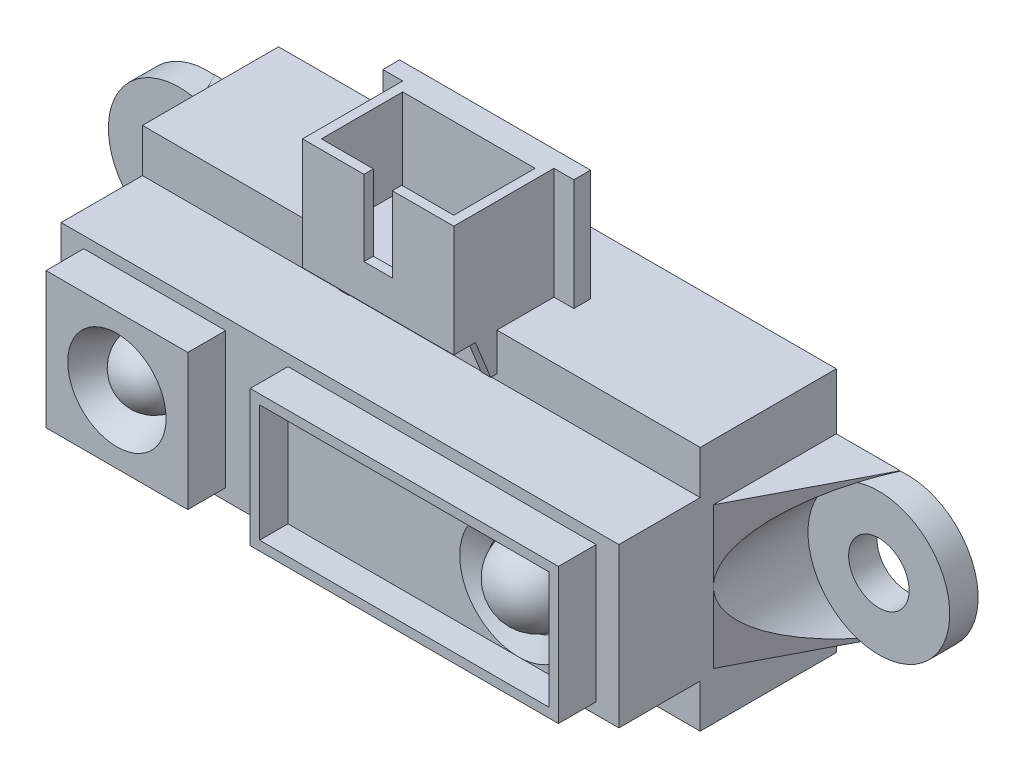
ISO-10303-21;
HEADER;
FILE_DESCRIPTION(('STEP AP214'),'2;1');
FILE_NAME('part.step','',(''),(''),'','','');
FILE_SCHEMA(('AUTOMOTIVE_DESIGN { 1 0 10303 214 1 1 1 1 }'));
ENDSEC;
DATA;
#1=APPLICATION_CONTEXT('core data for automotive mechanical design processes');
#2=APPLICATION_PROTOCOL_DEFINITION('international standard','automotive_design',2000,#1);
#3=PRODUCT_CONTEXT('',#1,'mechanical');
#4=PRODUCT('Part','Part','',(#3));
#5=PRODUCT_RELATED_PRODUCT_CATEGORY('part','',(#4));
#6=PRODUCT_DEFINITION_FORMATION('','',#4);
#7=PRODUCT_DEFINITION_CONTEXT('part definition',#1,'design');
#8=PRODUCT_DEFINITION('design','',#6,#7);
#9=PRODUCT_DEFINITION_SHAPE('','',#8);
#10=(LENGTH_UNIT() NAMED_UNIT(*) SI_UNIT(.MILLI.,.METRE.));
#11=(NAMED_UNIT(*) PLANE_ANGLE_UNIT() SI_UNIT($,.RADIAN.));
#12=(NAMED_UNIT(*) SI_UNIT($,.STERADIAN.) SOLID_ANGLE_UNIT());
#13=UNCERTAINTY_MEASURE_WITH_UNIT(LENGTH_MEASURE(1.E-05),#10,'distance_accuracy_value','');
#14=(GEOMETRIC_REPRESENTATION_CONTEXT(3) GLOBAL_UNCERTAINTY_ASSIGNED_CONTEXT((#13)) GLOBAL_UNIT_ASSIGNED_CONTEXT((#10,
#11,#12)) REPRESENTATION_CONTEXT('',''));
#15=CARTESIAN_POINT('',(0.,0.,0.));
#16=DIRECTION('',(0.,0.,1.));
#17=DIRECTION('',(1.,0.,0.));
#18=AXIS2_PLACEMENT_3D('',#15,#16,#17);
#19=CARTESIAN_POINT('',(0.,0.,18.3));
#20=DIRECTION('',(0.,0.,1.));
#21=DIRECTION('',(1.,0.,0.));
#22=AXIS2_PLACEMENT_3D('',#19,#20,#21);
#23=PLANE('',#22);
#24=CARTESIAN_POINT('',(24.6832361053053,6.49999999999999,18.3));
#25=DIRECTION('',(0.,0.,1.));
#26=DIRECTION('',(1.,0.,0.));
#27=AXIS2_PLACEMENT_3D('',#24,#25,#26);
#28=CIRCLE('',#27,3.10000000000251);
#29=CARTESIAN_POINT('',(24.6832361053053,9.59999999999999,18.3));
#30=VERTEX_POINT('',#29);
#31=CARTESIAN_POINT('',(24.6832361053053,3.4,18.3));
#32=VERTEX_POINT('',#31);
#33=EDGE_CURVE('E442',#30,#32,#28,.T.);
#34=ORIENTED_EDGE('',*,*,#33,.F.);
#35=DIRECTION('',(-1.,0.,0.));
#36=VECTOR('',#35,1.);
#37=CARTESIAN_POINT('',(27.8,9.59999999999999,18.3));
#38=LINE('',#37,#36);
#39=CARTESIAN_POINT('',(12.5,9.59999999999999,18.3));
#40=VERTEX_POINT('',#39);
#41=EDGE_CURVE('E501',#30,#40,#38,.T.);
#42=ORIENTED_EDGE('',*,*,#41,.T.);
#43=DIRECTION('',(0.,-1.,0.));
#44=VECTOR('',#43,1.);
#45=CARTESIAN_POINT('',(12.5,9.59999999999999,18.3));
#46=LINE('',#45,#44);
#47=CARTESIAN_POINT('',(12.5,3.4,18.3));
#48=VERTEX_POINT('',#47);
#49=EDGE_CURVE('E490',#40,#48,#46,.T.);
#50=ORIENTED_EDGE('',*,*,#49,.T.);
#51=DIRECTION('',(1.,0.,0.));
#52=VECTOR('',#51,1.);
#53=CARTESIAN_POINT('',(12.5,3.4,18.3));
#54=LINE('',#53,#52);
#55=EDGE_CURVE('E495',#48,#32,#54,.T.);
#56=ORIENTED_EDGE('',*,*,#55,.T.);
#57=EDGE_LOOP('',(#34,#42,#50,#56));
#58=FACE_BOUND('',#57,.T.);
#59=ADVANCED_FACE('F41',(#58),#23,.T.);
#60=CARTESIAN_POINT('',(0.,0.,17.8));
#61=DIRECTION('',(0.,0.,-1.));
#62=DIRECTION('',(-1.,0.,0.));
#63=AXIS2_PLACEMENT_3D('',#60,#61,#62);
#64=PLANE('',#63);
#65=DIRECTION('',(0.,-1.,0.));
#66=VECTOR('',#65,1.);
#67=CARTESIAN_POINT('',(1.2,2.9,17.8));
#68=LINE('',#67,#66);
#69=CARTESIAN_POINT('',(1.2,10.1,17.8));
#70=VERTEX_POINT('',#69);
#71=CARTESIAN_POINT('',(1.2,2.9,17.8));
#72=VERTEX_POINT('',#71);
#73=EDGE_CURVE('E556',#70,#72,#68,.T.);
#74=ORIENTED_EDGE('',*,*,#73,.F.);
#75=DIRECTION('',(-1.,0.,0.));
#76=VECTOR('',#75,1.);
#77=CARTESIAN_POINT('',(1.2,10.1,17.8));
#78=LINE('',#77,#76);
#79=CARTESIAN_POINT('',(8.7,10.1,17.8));
#80=VERTEX_POINT('',#79);
#81=EDGE_CURVE('E561',#80,#70,#78,.T.);
#82=ORIENTED_EDGE('',*,*,#81,.F.);
#83=DIRECTION('',(0.,1.,0.));
#84=VECTOR('',#83,1.);
#85=CARTESIAN_POINT('',(8.7,10.1,17.8));
#86=LINE('',#85,#84);
#87=CARTESIAN_POINT('',(8.7,2.89999999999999,17.8));
#88=VERTEX_POINT('',#87);
#89=EDGE_CURVE('E573',#88,#80,#86,.T.);
#90=ORIENTED_EDGE('',*,*,#89,.F.);
#91=DIRECTION('',(1.,0.,0.));
#92=VECTOR('',#91,1.);
#93=CARTESIAN_POINT('',(8.7,2.89999999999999,17.8));
#94=LINE('',#93,#92);
#95=EDGE_CURVE('E570',#72,#88,#94,.T.);
#96=ORIENTED_EDGE('',*,*,#95,.F.);
#97=EDGE_LOOP('',(#74,#82,#90,#96));
#98=FACE_BOUND('',#97,.T.);
#99=DIRECTION('',(0.,-1.,0.));
#100=VECTOR('',#99,1.);
#101=CARTESIAN_POINT('',(0.,0.,17.8));
#102=LINE('',#101,#100);
#103=CARTESIAN_POINT('',(0.,10.7,17.8));
#104=VERTEX_POINT('',#103);
#105=CARTESIAN_POINT('',(0.,2.3,17.8));
#106=VERTEX_POINT('',#105);
#107=EDGE_CURVE('E828',#104,#106,#102,.T.);
#108=ORIENTED_EDGE('',*,*,#107,.T.);
#109=DIRECTION('',(1.,0.,0.));
#110=VECTOR('',#109,1.);
#111=CARTESIAN_POINT('',(0.,2.3,17.8));
#112=LINE('',#111,#110);
#113=CARTESIAN_POINT('',(29.5,2.30000000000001,17.8));
#114=VERTEX_POINT('',#113);
#115=EDGE_CURVE('E781',#106,#114,#112,.T.);
#116=ORIENTED_EDGE('',*,*,#115,.T.);
#117=DIRECTION('',(0.,1.,0.));
#118=VECTOR('',#117,1.);
#119=CARTESIAN_POINT('',(29.5,10.0231235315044,17.8));
#120=LINE('',#119,#118);
#121=CARTESIAN_POINT('',(29.5,10.7,17.8));
#122=VERTEX_POINT('',#121);
#123=EDGE_CURVE('E946',#114,#122,#120,.T.);
#124=ORIENTED_EDGE('',*,*,#123,.T.);
#125=DIRECTION('',(-1.,0.,0.));
#126=VECTOR('',#125,1.);
#127=CARTESIAN_POINT('',(37.,10.7,17.8));
#128=LINE('',#127,#126);
#129=EDGE_CURVE('E917',#122,#104,#128,.T.);
#130=ORIENTED_EDGE('',*,*,#129,.T.);
#131=EDGE_LOOP('',(#108,#116,#124,#130));
#132=FACE_BOUND('',#131,.T.);
#133=DIRECTION('',(0.,1.,0.));
#134=VECTOR('',#133,1.);
#135=CARTESIAN_POINT('',(28.3,10.1,17.8));
#136=LINE('',#135,#134);
#137=CARTESIAN_POINT('',(28.3,2.89999999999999,17.8));
#138=VERTEX_POINT('',#137);
#139=CARTESIAN_POINT('',(28.3,10.1,17.8));
#140=VERTEX_POINT('',#139);
#141=EDGE_CURVE('E517',#138,#140,#136,.T.);
#142=ORIENTED_EDGE('',*,*,#141,.F.);
#143=DIRECTION('',(1.,0.,0.));
#144=VECTOR('',#143,1.);
#145=CARTESIAN_POINT('',(28.3,2.89999999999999,17.8));
#146=LINE('',#145,#144);
#147=CARTESIAN_POINT('',(12.,2.9,17.8));
#148=VERTEX_POINT('',#147);
#149=EDGE_CURVE('E528',#148,#138,#146,.T.);
#150=ORIENTED_EDGE('',*,*,#149,.F.);
#151=DIRECTION('',(0.,-1.,0.));
#152=VECTOR('',#151,1.);
#153=CARTESIAN_POINT('',(12.,2.9,17.8));
#154=LINE('',#153,#152);
#155=CARTESIAN_POINT('',(12.,10.1,17.8));
#156=VERTEX_POINT('',#155);
#157=EDGE_CURVE('E540',#156,#148,#154,.T.);
#158=ORIENTED_EDGE('',*,*,#157,.F.);
#159=DIRECTION('',(-1.,0.,0.));
#160=VECTOR('',#159,1.);
#161=CARTESIAN_POINT('',(12.,10.1,17.8));
#162=LINE('',#161,#160);
#163=EDGE_CURVE('E537',#140,#156,#162,.T.);
#164=ORIENTED_EDGE('',*,*,#163,.F.);
#165=EDGE_LOOP('',(#142,#150,#158,#164));
#166=FACE_BOUND('',#165,.T.);
#167=ADVANCED_FACE('F1008',(#98,#132,#166),#64,.F.);
#168=CARTESIAN_POINT('',(37.,13.,13.5));
#169=DIRECTION('',(0.,0.,-1.));
#170=DIRECTION('',(-1.,0.,0.));
#171=AXIS2_PLACEMENT_3D('',#168,#169,#170);
#172=PLANE('',#171);
#173=DIRECTION('',(1.,0.,0.));
#174=VECTOR('',#173,1.);
#175=CARTESIAN_POINT('',(0.,13.,13.5));
#176=LINE('',#175,#174);
#177=CARTESIAN_POINT('',(18.75,13.,13.5));
#178=VERTEX_POINT('',#177);
#179=CARTESIAN_POINT('',(29.5,13.,13.5));
#180=VERTEX_POINT('',#179);
#181=EDGE_CURVE('E807',#178,#180,#176,.T.);
#182=ORIENTED_EDGE('',*,*,#181,.F.);
#183=DIRECTION('',(0.,1.,0.));
#184=VECTOR('',#183,1.);
#185=CARTESIAN_POINT('',(18.75,18.9,13.5));
#186=LINE('',#185,#184);
#187=CARTESIAN_POINT('',(18.75,11.,13.5));
#188=VERTEX_POINT('',#187);
#189=EDGE_CURVE('E747',#188,#178,#186,.T.);
#190=ORIENTED_EDGE('',*,*,#189,.F.);
#191=DIRECTION('',(1.,0.,0.));
#192=VECTOR('',#191,1.);
#193=CARTESIAN_POINT('',(18.25,11.,13.5));
#194=LINE('',#193,#192);
#195=CARTESIAN_POINT('',(18.25,11.,13.5));
#196=VERTEX_POINT('',#195);
#197=EDGE_CURVE('E710',#196,#188,#194,.T.);
#198=ORIENTED_EDGE('',*,*,#197,.F.);
#199=DIRECTION('',(0.,1.,0.));
#200=VECTOR('',#199,1.);
#201=CARTESIAN_POINT('',(18.25,11.,13.5));
#202=LINE('',#201,#200);
#203=CARTESIAN_POINT('',(18.25,13.,13.5));
#204=VERTEX_POINT('',#203);
#205=EDGE_CURVE('E695',#196,#204,#202,.T.);
#206=ORIENTED_EDGE('',*,*,#205,.T.);
#207=DIRECTION('',(1.,0.,0.));
#208=VECTOR('',#207,1.);
#209=CARTESIAN_POINT('',(18.75,13.,13.5));
#210=LINE('',#209,#208);
#211=CARTESIAN_POINT('',(11.25,13.,13.5));
#212=VERTEX_POINT('',#211);
#213=EDGE_CURVE('E744',#212,#204,#210,.T.);
#214=ORIENTED_EDGE('',*,*,#213,.F.);
#215=DIRECTION('',(0.,1.,0.));
#216=VECTOR('',#215,1.);
#217=CARTESIAN_POINT('',(11.25,11.,13.5));
#218=LINE('',#217,#216);
#219=CARTESIAN_POINT('',(11.25,11.,13.5));
#220=VERTEX_POINT('',#219);
#221=EDGE_CURVE('E728',#220,#212,#218,.T.);
#222=ORIENTED_EDGE('',*,*,#221,.F.);
#223=DIRECTION('',(1.,0.,0.));
#224=VECTOR('',#223,1.);
#225=CARTESIAN_POINT('',(11.25,11.,13.5));
#226=LINE('',#225,#224);
#227=CARTESIAN_POINT('',(10.75,11.,13.5));
#228=VERTEX_POINT('',#227);
#229=EDGE_CURVE('E716',#228,#220,#226,.T.);
#230=ORIENTED_EDGE('',*,*,#229,.F.);
#231=DIRECTION('',(0.,-1.,0.));
#232=VECTOR('',#231,1.);
#233=CARTESIAN_POINT('',(10.75,13.,13.5));
#234=LINE('',#233,#232);
#235=CARTESIAN_POINT('',(10.75,13.,13.5));
#236=VERTEX_POINT('',#235);
#237=EDGE_CURVE('E742',#236,#228,#234,.T.);
#238=ORIENTED_EDGE('',*,*,#237,.F.);
#239=CARTESIAN_POINT('',(0.,13.,13.5));
#240=VERTEX_POINT('',#239);
#241=EDGE_CURVE('E785',#240,#236,#176,.T.);
#242=ORIENTED_EDGE('',*,*,#241,.F.);
#243=DIRECTION('',(0.,-1.,0.));
#244=VECTOR('',#243,1.);
#245=CARTESIAN_POINT('',(0.,13.,13.5));
#246=LINE('',#245,#244);
#247=CARTESIAN_POINT('',(0.,10.7,13.5));
#248=VERTEX_POINT('',#247);
#249=EDGE_CURVE('E910',#240,#248,#246,.T.);
#250=ORIENTED_EDGE('',*,*,#249,.T.);
#251=DIRECTION('',(-1.,0.,0.));
#252=VECTOR('',#251,1.);
#253=CARTESIAN_POINT('',(37.,10.7,13.5));
#254=LINE('',#253,#252);
#255=CARTESIAN_POINT('',(29.5,10.7,13.5));
#256=VERTEX_POINT('',#255);
#257=EDGE_CURVE('E916',#256,#248,#254,.T.);
#258=ORIENTED_EDGE('',*,*,#257,.F.);
#259=DIRECTION('',(0.,-1.,0.));
#260=VECTOR('',#259,1.);
#261=CARTESIAN_POINT('',(29.5,0.,13.5));
#262=LINE('',#261,#260);
#263=EDGE_CURVE('E920',#180,#256,#262,.T.);
#264=ORIENTED_EDGE('',*,*,#263,.F.);
#265=EDGE_LOOP('',(#182,#190,#198,#206,#214,#222,#230,#238,#242,#250,#258,#264));
#266=FACE_BOUND('',#265,.T.);
#267=ADVANCED_FACE('F856',(#266),#172,.F.);
#268=CARTESIAN_POINT('',(19.8,18.9,9.6));
#269=DIRECTION('',(-1.,0.,0.));
#270=DIRECTION('',(0.,0.,1.));
#271=AXIS2_PLACEMENT_3D('',#268,#269,#270);
#272=PLANE('',#271);
#273=DIRECTION('',(0.,-1.,0.));
#274=VECTOR('',#273,1.);
#275=CARTESIAN_POINT('',(19.8,18.9,10.4837708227));
#276=LINE('',#275,#274);
#277=CARTESIAN_POINT('',(19.8,18.9,10.4837708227));
#278=VERTEX_POINT('',#277);
#279=CARTESIAN_POINT('',(19.8,13.,10.4837708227));
#280=VERTEX_POINT('',#279);
#281=EDGE_CURVE('E669',#278,#280,#276,.T.);
#282=ORIENTED_EDGE('',*,*,#281,.T.);
#283=DIRECTION('',(0.,0.,-1.));
#284=VECTOR('',#283,1.);
#285=CARTESIAN_POINT('',(19.8,13.,9.6));
#286=LINE('',#285,#284);
#287=CARTESIAN_POINT('',(19.8,13.,9.6));
#288=VERTEX_POINT('',#287);
#289=EDGE_CURVE('E758',#280,#288,#286,.T.);
#290=ORIENTED_EDGE('',*,*,#289,.T.);
#291=DIRECTION('',(0.,-1.,0.));
#292=VECTOR('',#291,1.);
#293=CARTESIAN_POINT('',(19.8,18.9,9.6));
#294=LINE('',#293,#292);
#295=CARTESIAN_POINT('',(19.8,18.9,9.6));
#296=VERTEX_POINT('',#295);
#297=EDGE_CURVE('E907',#296,#288,#294,.T.);
#298=ORIENTED_EDGE('',*,*,#297,.F.);
#299=DIRECTION('',(0.,0.,-1.));
#300=VECTOR('',#299,1.);
#301=CARTESIAN_POINT('',(19.8,18.9,9.6));
#302=LINE('',#301,#300);
#303=EDGE_CURVE('E759',#278,#296,#302,.T.);
#304=ORIENTED_EDGE('',*,*,#303,.F.);
#305=EDGE_LOOP('',(#282,#290,#298,#304));
#306=FACE_BOUND('',#305,.T.);
#307=ADVANCED_FACE('F1651',(#306),#272,.F.);
#308=CARTESIAN_POINT('',(0.,18.9,0.));
#309=DIRECTION('',(0.,-1.,0.));
#310=DIRECTION('',(0.,0.,-1.));
#311=AXIS2_PLACEMENT_3D('',#308,#309,#310);
#312=PLANE('',#311);
#313=DIRECTION('',(-1.,0.,0.));
#314=VECTOR('',#313,1.);
#315=CARTESIAN_POINT('',(10.75,18.9,15.7837708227));
#316=LINE('',#315,#314);
#317=CARTESIAN_POINT('',(14.,18.9,15.7837708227));
#318=VERTEX_POINT('',#317);
#319=CARTESIAN_POINT('',(10.75,18.9,15.7837708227));
#320=VERTEX_POINT('',#319);
#321=EDGE_CURVE('E735',#318,#320,#316,.T.);
#322=ORIENTED_EDGE('',*,*,#321,.F.);
#323=DIRECTION('',(0.,0.,1.));
#324=VECTOR('',#323,1.);
#325=CARTESIAN_POINT('',(14.,18.9,6.298975));
#326=LINE('',#325,#324);
#327=CARTESIAN_POINT('',(14.,18.9,15.2837708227));
#328=VERTEX_POINT('',#327);
#329=EDGE_CURVE('E609',#328,#318,#326,.T.);
#330=ORIENTED_EDGE('',*,*,#329,.F.);
#331=DIRECTION('',(1.,0.,0.));
#332=VECTOR('',#331,1.);
#333=CARTESIAN_POINT('',(11.25,18.9,15.2837708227));
#334=LINE('',#333,#332);
#335=CARTESIAN_POINT('',(11.25,18.9,15.2837708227));
#336=VERTEX_POINT('',#335);
#337=EDGE_CURVE('E650',#336,#328,#334,.T.);
#338=ORIENTED_EDGE('',*,*,#337,.F.);
#339=DIRECTION('',(0.,0.,1.));
#340=VECTOR('',#339,1.);
#341=CARTESIAN_POINT('',(11.25,18.9,10.9837708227));
#342=LINE('',#341,#340);
#343=CARTESIAN_POINT('',(11.25,18.9,10.9837708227));
#344=VERTEX_POINT('',#343);
#345=EDGE_CURVE('E646',#344,#336,#342,.T.);
#346=ORIENTED_EDGE('',*,*,#345,.F.);
#347=DIRECTION('',(-1.,0.,0.));
#348=VECTOR('',#347,1.);
#349=CARTESIAN_POINT('',(18.25,18.9,10.9837708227));
#350=LINE('',#349,#348);
#351=CARTESIAN_POINT('',(18.25,18.9,10.9837708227));
#352=VERTEX_POINT('',#351);
#353=EDGE_CURVE('E630',#352,#344,#350,.T.);
#354=ORIENTED_EDGE('',*,*,#353,.F.);
#355=DIRECTION('',(0.,0.,-1.));
#356=VECTOR('',#355,1.);
#357=CARTESIAN_POINT('',(18.25,18.9,15.2837708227));
#358=LINE('',#357,#356);
#359=CARTESIAN_POINT('',(18.25,18.9,15.2837708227));
#360=VERTEX_POINT('',#359);
#361=EDGE_CURVE('E635',#360,#352,#358,.T.);
#362=ORIENTED_EDGE('',*,*,#361,.F.);
#363=CARTESIAN_POINT('',(15.5,18.9,15.2837708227));
#364=VERTEX_POINT('',#363);
#365=EDGE_CURVE('E649',#364,#360,#334,.T.);
#366=ORIENTED_EDGE('',*,*,#365,.F.);
#367=DIRECTION('',(0.,0.,1.));
#368=VECTOR('',#367,1.);
#369=CARTESIAN_POINT('',(15.5,18.9,6.298975));
#370=LINE('',#369,#368);
#371=CARTESIAN_POINT('',(15.5,18.9,15.7837708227));
#372=VERTEX_POINT('',#371);
#373=EDGE_CURVE('E624',#364,#372,#370,.T.);
#374=ORIENTED_EDGE('',*,*,#373,.T.);
#375=CARTESIAN_POINT('',(18.75,18.9,15.7837708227));
#376=VERTEX_POINT('',#375);
#377=EDGE_CURVE('E731',#376,#372,#316,.T.);
#378=ORIENTED_EDGE('',*,*,#377,.F.);
#379=DIRECTION('',(0.,0.,-1.));
#380=VECTOR('',#379,1.);
#381=CARTESIAN_POINT('',(18.75,18.9,15.7837708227));
#382=LINE('',#381,#380);
#383=CARTESIAN_POINT('',(18.75,18.9,10.4837708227));
#384=VERTEX_POINT('',#383);
#385=EDGE_CURVE('E741',#376,#384,#382,.T.);
#386=ORIENTED_EDGE('',*,*,#385,.T.);
#387=DIRECTION('',(1.,0.,0.));
#388=VECTOR('',#387,1.);
#389=CARTESIAN_POINT('',(18.75,18.9,10.4837708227));
#390=LINE('',#389,#388);
#391=EDGE_CURVE('E672',#384,#278,#390,.T.);
#392=ORIENTED_EDGE('',*,*,#391,.T.);
#393=ORIENTED_EDGE('',*,*,#303,.T.);
#394=DIRECTION('',(-1.,0.,0.));
#395=VECTOR('',#394,1.);
#396=CARTESIAN_POINT('',(9.7,18.9,9.6));
#397=LINE('',#396,#395);
#398=CARTESIAN_POINT('',(9.7,18.9,9.6));
#399=VERTEX_POINT('',#398);
#400=EDGE_CURVE('E761',#296,#399,#397,.T.);
#401=ORIENTED_EDGE('',*,*,#400,.T.);
#402=DIRECTION('',(0.,0.,1.));
#403=VECTOR('',#402,1.);
#404=CARTESIAN_POINT('',(9.7,18.9,13.5));
#405=LINE('',#404,#403);
#406=CARTESIAN_POINT('',(9.7,18.9,10.4837708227));
#407=VERTEX_POINT('',#406);
#408=EDGE_CURVE('E764',#399,#407,#405,.T.);
#409=ORIENTED_EDGE('',*,*,#408,.T.);
#410=DIRECTION('',(-1.,0.,0.));
#411=VECTOR('',#410,1.);
#412=CARTESIAN_POINT('',(10.75,18.9,10.4837708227));
#413=LINE('',#412,#411);
#414=CARTESIAN_POINT('',(10.75,18.9,10.4837708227));
#415=VERTEX_POINT('',#414);
#416=EDGE_CURVE('E681',#415,#407,#413,.T.);
#417=ORIENTED_EDGE('',*,*,#416,.F.);
#418=DIRECTION('',(0.,0.,-1.));
#419=VECTOR('',#418,1.);
#420=CARTESIAN_POINT('',(10.75,18.9,15.7837708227));
#421=LINE('',#420,#419);
#422=EDGE_CURVE('E756',#320,#415,#421,.T.);
#423=ORIENTED_EDGE('',*,*,#422,.F.);
#424=EDGE_LOOP('',(#322,#330,#338,#346,#354,#362,#366,#374,#378,#386,#392,#393,#401,#409,#417,#423));
#425=FACE_BOUND('',#424,.T.);
#426=ADVANCED_FACE('F887',(#425),#312,.F.);
#427=CARTESIAN_POINT('',(9.7,18.9,13.5));
#428=DIRECTION('',(1.,0.,0.));
#429=DIRECTION('',(0.,0.,-1.));
#430=AXIS2_PLACEMENT_3D('',#427,#428,#429);
#431=PLANE('',#430);
#432=DIRECTION('',(0.,-1.,0.));
#433=VECTOR('',#432,1.);
#434=CARTESIAN_POINT('',(9.7,18.9,10.4837708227));
#435=LINE('',#434,#433);
#436=CARTESIAN_POINT('',(9.7,13.,10.4837708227));
#437=VERTEX_POINT('',#436);
#438=EDGE_CURVE('E683',#407,#437,#435,.T.);
#439=ORIENTED_EDGE('',*,*,#438,.F.);
#440=ORIENTED_EDGE('',*,*,#408,.F.);
#441=DIRECTION('',(0.,-1.,0.));
#442=VECTOR('',#441,1.);
#443=CARTESIAN_POINT('',(9.7,18.9,9.6));
#444=LINE('',#443,#442);
#445=CARTESIAN_POINT('',(9.7,13.,9.6));
#446=VERTEX_POINT('',#445);
#447=EDGE_CURVE('E767',#399,#446,#444,.T.);
#448=ORIENTED_EDGE('',*,*,#447,.T.);
#449=DIRECTION('',(0.,0.,1.));
#450=VECTOR('',#449,1.);
#451=CARTESIAN_POINT('',(9.7,13.,13.5));
#452=LINE('',#451,#450);
#453=EDGE_CURVE('E762',#446,#437,#452,.T.);
#454=ORIENTED_EDGE('',*,*,#453,.T.);
#455=EDGE_LOOP('',(#439,#440,#448,#454));
#456=FACE_BOUND('',#455,.T.);
#457=ADVANCED_FACE('F895',(#456),#431,.F.);
#458=CARTESIAN_POINT('',(18.75,13.,15.7837708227));
#459=DIRECTION('',(0.,1.,0.));
#460=DIRECTION('',(0.,0.,1.));
#461=AXIS2_PLACEMENT_3D('',#458,#459,#460);
#462=PLANE('',#461);
#463=DIRECTION('',(0.,0.,1.));
#464=VECTOR('',#463,1.);
#465=CARTESIAN_POINT('',(18.25,13.,13.5));
#466=LINE('',#465,#464);
#467=CARTESIAN_POINT('',(18.25,13.,14.64188541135));
#468=VERTEX_POINT('',#467);
#469=EDGE_CURVE('E699',#204,#468,#466,.T.);
#470=ORIENTED_EDGE('',*,*,#469,.T.);
#471=DIRECTION('',(1.,0.,0.));
#472=VECTOR('',#471,1.);
#473=CARTESIAN_POINT('',(18.25,13.,14.64188541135));
#474=LINE('',#473,#472);
#475=CARTESIAN_POINT('',(18.75,13.,14.64188541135));
#476=VERTEX_POINT('',#475);
#477=EDGE_CURVE('E706',#468,#476,#474,.T.);
#478=ORIENTED_EDGE('',*,*,#477,.T.);
#479=DIRECTION('',(0.,0.,-1.));
#480=VECTOR('',#479,1.);
#481=CARTESIAN_POINT('',(18.75,13.,15.7837708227));
#482=LINE('',#481,#480);
#483=CARTESIAN_POINT('',(18.75,13.,15.7837708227));
#484=VERTEX_POINT('',#483);
#485=EDGE_CURVE('E751',#484,#476,#482,.T.);
#486=ORIENTED_EDGE('',*,*,#485,.F.);
#487=DIRECTION('',(1.,0.,0.));
#488=VECTOR('',#487,1.);
#489=CARTESIAN_POINT('',(18.75,13.,15.7837708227));
#490=LINE('',#489,#488);
#491=CARTESIAN_POINT('',(10.75,13.,15.7837708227));
#492=VERTEX_POINT('',#491);
#493=EDGE_CURVE('E737',#492,#484,#490,.T.);
#494=ORIENTED_EDGE('',*,*,#493,.F.);
#495=DIRECTION('',(0.,0.,-1.));
#496=VECTOR('',#495,1.);
#497=CARTESIAN_POINT('',(10.75,13.,15.7837708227));
#498=LINE('',#497,#496);
#499=CARTESIAN_POINT('',(10.75,13.,14.64188541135));
#500=VERTEX_POINT('',#499);
#501=EDGE_CURVE('E754',#492,#500,#498,.T.);
#502=ORIENTED_EDGE('',*,*,#501,.T.);
#503=DIRECTION('',(-1.,0.,0.));
#504=VECTOR('',#503,1.);
#505=CARTESIAN_POINT('',(10.75,13.,14.64188541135));
#506=LINE('',#505,#504);
#507=CARTESIAN_POINT('',(11.25,13.,14.64188541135));
#508=VERTEX_POINT('',#507);
#509=EDGE_CURVE('E709',#508,#500,#506,.T.);
#510=ORIENTED_EDGE('',*,*,#509,.F.);
#511=DIRECTION('',(0.,0.,1.));
#512=VECTOR('',#511,1.);
#513=CARTESIAN_POINT('',(11.25,13.,14.64188541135));
#514=LINE('',#513,#512);
#515=EDGE_CURVE('E725',#212,#508,#514,.T.);
#516=ORIENTED_EDGE('',*,*,#515,.F.);
#517=ORIENTED_EDGE('',*,*,#213,.T.);
#518=EDGE_LOOP('',(#470,#478,#486,#494,#502,#510,#516,#517));
#519=FACE_BOUND('',#518,.T.);
#520=ADVANCED_FACE('F861',(#519),#462,.F.);
#521=CARTESIAN_POINT('',(0.,13.,0.));
#522=DIRECTION('',(0.,-1.,0.));
#523=DIRECTION('',(1.,0.,0.));
#524=AXIS2_PLACEMENT_3D('',#521,#522,#523);
#525=PLANE('',#524);
#526=ORIENTED_EDGE('',*,*,#453,.F.);
#527=DIRECTION('',(-1.,0.,0.));
#528=VECTOR('',#527,1.);
#529=CARTESIAN_POINT('',(9.7,13.,9.6));
#530=LINE('',#529,#528);
#531=EDGE_CURVE('E768',#288,#446,#530,.T.);
#532=ORIENTED_EDGE('',*,*,#531,.F.);
#533=ORIENTED_EDGE('',*,*,#289,.F.);
#534=DIRECTION('',(-1.,0.,0.));
#535=VECTOR('',#534,1.);
#536=CARTESIAN_POINT('',(19.8,13.,10.4837708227));
#537=LINE('',#536,#535);
#538=CARTESIAN_POINT('',(18.75,13.,10.4837708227));
#539=VERTEX_POINT('',#538);
#540=EDGE_CURVE('E667',#280,#539,#537,.T.);
#541=ORIENTED_EDGE('',*,*,#540,.T.);
#542=DIRECTION('',(0.,0.,1.));
#543=VECTOR('',#542,1.);
#544=CARTESIAN_POINT('',(18.75,13.,10.4837708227));
#545=LINE('',#544,#543);
#546=EDGE_CURVE('E675',#539,#178,#545,.T.);
#547=ORIENTED_EDGE('',*,*,#546,.T.);
#548=ORIENTED_EDGE('',*,*,#181,.T.);
#549=DIRECTION('',(0.,0.,-1.));
#550=VECTOR('',#549,1.);
#551=CARTESIAN_POINT('',(29.5,13.,6.3));
#552=LINE('',#551,#550);
#553=CARTESIAN_POINT('',(29.5,13.,6.3));
#554=VERTEX_POINT('',#553);
#555=EDGE_CURVE('E928',#180,#554,#552,.T.);
#556=ORIENTED_EDGE('',*,*,#555,.T.);
#557=DIRECTION('',(-1.,0.,0.));
#558=VECTOR('',#557,1.);
#559=CARTESIAN_POINT('',(0.,13.,6.3));
#560=LINE('',#559,#558);
#561=CARTESIAN_POINT('',(0.,13.,6.3));
#562=VERTEX_POINT('',#561);
#563=EDGE_CURVE('E930',#554,#562,#560,.T.);
#564=ORIENTED_EDGE('',*,*,#563,.T.);
#565=DIRECTION('',(0.,0.,1.));
#566=VECTOR('',#565,1.);
#567=CARTESIAN_POINT('',(0.,13.,17.8));
#568=LINE('',#567,#566);
#569=EDGE_CURVE('E933',#562,#240,#568,.T.);
#570=ORIENTED_EDGE('',*,*,#569,.T.);
#571=ORIENTED_EDGE('',*,*,#241,.T.);
#572=DIRECTION('',(0.,0.,1.));
#573=VECTOR('',#572,1.);
#574=CARTESIAN_POINT('',(10.75,13.,10.4837708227));
#575=LINE('',#574,#573);
#576=CARTESIAN_POINT('',(10.75,13.,10.4837708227));
#577=VERTEX_POINT('',#576);
#578=EDGE_CURVE('E688',#577,#236,#575,.T.);
#579=ORIENTED_EDGE('',*,*,#578,.F.);
#580=DIRECTION('',(1.,0.,0.));
#581=VECTOR('',#580,1.);
#582=CARTESIAN_POINT('',(9.7,13.,10.4837708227));
#583=LINE('',#582,#581);
#584=EDGE_CURVE('E685',#437,#577,#583,.T.);
#585=ORIENTED_EDGE('',*,*,#584,.F.);
#586=EDGE_LOOP('',(#526,#532,#533,#541,#547,#548,#556,#564,#570,#571,#579,#585));
#587=FACE_BOUND('',#586,.T.);
#588=ADVANCED_FACE('F900',(#587),#525,.F.);
#589=CARTESIAN_POINT('',(-3.75,10.0231235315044,7.8));
#590=DIRECTION('',(0.,1.,0.));
#591=DIRECTION('',(-1.,0.,0.));
#592=AXIS2_PLACEMENT_3D('',#589,#590,#591);
#593=PLANE('',#592);
#594=DIRECTION('',(-0.461352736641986,0.,0.887216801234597));
#595=VECTOR('',#594,1.);
#596=CARTESIAN_POINT('',(29.5,10.0231235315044,12.8));
#597=LINE('',#596,#595);
#598=CARTESIAN_POINT('',(32.88,10.0231235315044,6.3));
#599=VERTEX_POINT('',#598);
#600=CARTESIAN_POINT('',(29.5,10.0231235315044,12.8));
#601=VERTEX_POINT('',#600);
#602=EDGE_CURVE('E786',#599,#601,#597,.T.);
#603=ORIENTED_EDGE('',*,*,#602,.F.);
#604=DIRECTION('',(1.,0.,0.));
#605=VECTOR('',#604,1.);
#606=CARTESIAN_POINT('',(-3.75,10.0231235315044,6.3));
#607=LINE('',#606,#605);
#608=CARTESIAN_POINT('',(29.5,10.0231235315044,6.3));
#609=VERTEX_POINT('',#608);
#610=EDGE_CURVE('E982',#609,#599,#607,.T.);
#611=ORIENTED_EDGE('',*,*,#610,.F.);
#612=DIRECTION('',(0.,0.,-1.));
#613=VECTOR('',#612,1.);
#614=CARTESIAN_POINT('',(29.5,10.0231235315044,6.3));
#615=LINE('',#614,#613);
#616=EDGE_CURVE('E927',#601,#609,#615,.T.);
#617=ORIENTED_EDGE('',*,*,#616,.F.);
#618=EDGE_LOOP('',(#603,#611,#617));
#619=FACE_BOUND('',#618,.T.);
#620=ADVANCED_FACE('F1264',(#619),#593,.T.);
#621=CARTESIAN_POINT('',(-3.37999999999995,10.0231235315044,6.3));
#622=VERTEX_POINT('',#621);
#623=CARTESIAN_POINT('',(0.,10.0231235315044,6.3));
#624=VERTEX_POINT('',#623);
#625=EDGE_CURVE('E973',#622,#624,#607,.T.);
#626=ORIENTED_EDGE('',*,*,#625,.F.);
#627=DIRECTION('',(-0.461352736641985,0.,-0.887216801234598));
#628=VECTOR('',#627,1.);
#629=CARTESIAN_POINT('',(0.,10.0231235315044,12.8));
#630=LINE('',#629,#628);
#631=CARTESIAN_POINT('',(0.,10.0231235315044,12.8));
#632=VERTEX_POINT('',#631);
#633=EDGE_CURVE('E790',#632,#622,#630,.T.);
#634=ORIENTED_EDGE('',*,*,#633,.F.);
#635=DIRECTION('',(0.,0.,1.));
#636=VECTOR('',#635,1.);
#637=CARTESIAN_POINT('',(0.,10.0231235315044,17.8));
#638=LINE('',#637,#636);
#639=EDGE_CURVE('E931',#624,#632,#638,.T.);
#640=ORIENTED_EDGE('',*,*,#639,.F.);
#641=EDGE_LOOP('',(#626,#634,#640));
#642=FACE_BOUND('',#641,.T.);
#643=ADVANCED_FACE('F1024',(#642),#593,.T.);
#644=CARTESIAN_POINT('',(29.5,10.0231235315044,12.8));
#645=DIRECTION('',(0.887216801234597,0.,0.461352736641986));
#646=DIRECTION('',(0.461352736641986,0.,-0.887216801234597));
#647=AXIS2_PLACEMENT_3D('',#644,#645,#646);
#648=PLANE('',#647);
#649=DIRECTION('',(0.461352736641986,0.,-0.887216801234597));
#650=VECTOR('',#649,1.);
#651=CARTESIAN_POINT('',(29.5,2.52312353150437,12.8));
#652=LINE('',#651,#650);
#653=CARTESIAN_POINT('',(29.5,2.52312353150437,12.8));
#654=VERTEX_POINT('',#653);
#655=CARTESIAN_POINT('',(32.88,2.52312353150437,6.3));
#656=VERTEX_POINT('',#655);
#657=EDGE_CURVE('E799',#654,#656,#652,.T.);
#658=ORIENTED_EDGE('',*,*,#657,.T.);
#659=DIRECTION('',(0.,1.,0.));
#660=VECTOR('',#659,1.);
#661=CARTESIAN_POINT('',(32.88,10.0231235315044,6.3));
#662=LINE('',#661,#660);
#663=CARTESIAN_POINT('',(32.88,2.54142150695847,6.3));
#664=VERTEX_POINT('',#663);
#665=EDGE_CURVE('E784',#656,#664,#662,.T.);
#666=ORIENTED_EDGE('',*,*,#665,.T.);
#667=CARTESIAN_POINT('',(33.25,6.27312353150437,5.58846153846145));
#668=DIRECTION('',(0.887216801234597,0.,0.461352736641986));
#669=DIRECTION('',(0.461352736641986,0.,-0.887216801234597));
#670=AXIS2_PLACEMENT_3D('',#667,#668,#669);
#671=ELLIPSE('',#670,8.12827084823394,3.75);
#672=CARTESIAN_POINT('',(32.1,2.70380987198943,7.8));
#673=VERTEX_POINT('',#672);
#674=EDGE_CURVE('E794',#664,#673,#671,.F.);
#675=ORIENTED_EDGE('',*,*,#674,.T.);
#676=CARTESIAN_POINT('',(29.5,6.27312353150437,12.8));
#677=VERTEX_POINT('',#676);
#678=EDGE_CURVE('E796',#673,#677,#671,.F.);
#679=ORIENTED_EDGE('',*,*,#678,.T.);
#680=DIRECTION('',(0.,1.,0.));
#681=VECTOR('',#680,1.);
#682=CARTESIAN_POINT('',(29.5,10.0231235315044,12.8));
#683=LINE('',#682,#681);
#684=EDGE_CURVE('E804',#654,#677,#683,.T.);
#685=ORIENTED_EDGE('',*,*,#684,.F.);
#686=EDGE_LOOP('',(#658,#666,#675,#679,#685));
#687=FACE_BOUND('',#686,.T.);
#688=ADVANCED_FACE('F1278',(#687),#648,.T.);
#689=CARTESIAN_POINT('',(29.5,10.0231235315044,12.8));
#690=DIRECTION('',(0.887216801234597,0.,0.461352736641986));
#691=DIRECTION('',(0.461352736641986,0.,-0.887216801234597));
#692=AXIS2_PLACEMENT_3D('',#689,#690,#691);
#693=PLANE('',#692);
#694=DIRECTION('',(0.,-1.,0.));
#695=VECTOR('',#694,1.);
#696=CARTESIAN_POINT('',(32.88,6.27312353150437,6.3));
#697=LINE('',#696,#695);
#698=CARTESIAN_POINT('',(32.88,10.0048255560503,6.3));
#699=VERTEX_POINT('',#698);
#700=EDGE_CURVE('E811',#599,#699,#697,.T.);
#701=ORIENTED_EDGE('',*,*,#700,.F.);
#702=ORIENTED_EDGE('',*,*,#602,.T.);
#703=DIRECTION('',(0.,1.,0.));
#704=VECTOR('',#703,1.);
#705=CARTESIAN_POINT('',(29.5,10.0231235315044,12.8));
#706=LINE('',#705,#704);
#707=EDGE_CURVE('E808',#677,#601,#706,.T.);
#708=ORIENTED_EDGE('',*,*,#707,.F.);
#709=CARTESIAN_POINT('',(33.25,6.27312353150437,5.58846153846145));
#710=DIRECTION('',(0.887216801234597,0.,0.461352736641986));
#711=DIRECTION('',(0.461352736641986,0.,-0.887216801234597));
#712=AXIS2_PLACEMENT_3D('',#709,#710,#711);
#713=ELLIPSE('',#712,8.12827084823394,3.75);
#714=CARTESIAN_POINT('',(32.1,9.84243719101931,7.8));
#715=VERTEX_POINT('',#714);
#716=EDGE_CURVE('E795',#677,#715,#713,.F.);
#717=ORIENTED_EDGE('',*,*,#716,.T.);
#718=EDGE_CURVE('E791',#715,#699,#713,.F.);
#719=ORIENTED_EDGE('',*,*,#718,.T.);
#720=EDGE_LOOP('',(#701,#702,#708,#717,#719));
#721=FACE_BOUND('',#720,.T.);
#722=ADVANCED_FACE('F1283',(#721),#693,.T.);
#723=CARTESIAN_POINT('',(0.,0.,12.8));
#724=DIRECTION('',(-0.887216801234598,0.,0.461352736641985));
#725=DIRECTION('',(0.461352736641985,0.,0.887216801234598));
#726=AXIS2_PLACEMENT_3D('',#723,#724,#725);
#727=PLANE('',#726);
#728=ORIENTED_EDGE('',*,*,#633,.T.);
#729=DIRECTION('',(0.,-1.,0.));
#730=VECTOR('',#729,1.);
#731=CARTESIAN_POINT('',(-3.37999999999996,0.,6.3));
#732=LINE('',#731,#730);
#733=CARTESIAN_POINT('',(-3.37999999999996,10.0048255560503,6.3));
#734=VERTEX_POINT('',#733);
#735=EDGE_CURVE('E50',#622,#734,#732,.T.);
#736=ORIENTED_EDGE('',*,*,#735,.T.);
#737=CARTESIAN_POINT('',(-3.75,6.27312353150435,5.58846153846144));
#738=DIRECTION('',(-0.887216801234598,0.,0.461352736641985));
#739=DIRECTION('',(-0.461352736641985,0.,-0.887216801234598));
#740=AXIS2_PLACEMENT_3D('',#737,#738,#739);
#741=ELLIPSE('',#740,8.12827084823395,3.75);
#742=CARTESIAN_POINT('',(-2.59999999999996,9.84243719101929,7.8));
#743=VERTEX_POINT('',#742);
#744=EDGE_CURVE('E819',#734,#743,#741,.F.);
#745=ORIENTED_EDGE('',*,*,#744,.T.);
#746=CARTESIAN_POINT('',(0.,6.27312353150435,12.8));
#747=VERTEX_POINT('',#746);
#748=EDGE_CURVE('E803',#743,#747,#741,.F.);
#749=ORIENTED_EDGE('',*,*,#748,.T.);
#750=DIRECTION('',(0.,-1.,0.));
#751=VECTOR('',#750,1.);
#752=CARTESIAN_POINT('',(0.,0.,12.8));
#753=LINE('',#752,#751);
#754=EDGE_CURVE('E825',#632,#747,#753,.T.);
#755=ORIENTED_EDGE('',*,*,#754,.F.);
#756=EDGE_LOOP('',(#728,#736,#745,#749,#755));
#757=FACE_BOUND('',#756,.T.);
#758=ADVANCED_FACE('F1026',(#757),#727,.T.);
#759=CARTESIAN_POINT('',(33.25,2.52312353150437,7.8));
#760=DIRECTION('',(0.,-1.,0.));
#761=DIRECTION('',(1.,0.,0.));
#762=AXIS2_PLACEMENT_3D('',#759,#760,#761);
#763=PLANE('',#762);
#764=DIRECTION('',(0.461352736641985,0.,0.887216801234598));
#765=VECTOR('',#764,1.);
#766=CARTESIAN_POINT('',(0.,2.52312353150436,12.8));
#767=LINE('',#766,#765);
#768=CARTESIAN_POINT('',(-3.37999999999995,2.52312353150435,6.3));
#769=VERTEX_POINT('',#768);
#770=CARTESIAN_POINT('',(0.,2.52312353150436,12.8));
#771=VERTEX_POINT('',#770);
#772=EDGE_CURVE('E802',#769,#771,#767,.T.);
#773=ORIENTED_EDGE('',*,*,#772,.F.);
#774=DIRECTION('',(-1.,0.,0.));
#775=VECTOR('',#774,1.);
#776=CARTESIAN_POINT('',(33.25,2.52312353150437,6.3));
#777=LINE('',#776,#775);
#778=CARTESIAN_POINT('',(0.,2.52312353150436,6.3));
#779=VERTEX_POINT('',#778);
#780=EDGE_CURVE('E976',#779,#769,#777,.T.);
#781=ORIENTED_EDGE('',*,*,#780,.F.);
#782=DIRECTION('',(0.,0.,-1.));
#783=VECTOR('',#782,1.);
#784=CARTESIAN_POINT('',(0.,2.52312353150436,6.3));
#785=LINE('',#784,#783);
#786=EDGE_CURVE('E948',#771,#779,#785,.T.);
#787=ORIENTED_EDGE('',*,*,#786,.F.);
#788=EDGE_LOOP('',(#773,#781,#787));
#789=FACE_BOUND('',#788,.T.);
#790=ADVANCED_FACE('F1038',(#789),#763,.T.);
#791=CARTESIAN_POINT('',(29.5,2.52312353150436,6.3));
#792=VERTEX_POINT('',#791);
#793=EDGE_CURVE('E977',#656,#792,#777,.T.);
#794=ORIENTED_EDGE('',*,*,#793,.F.);
#795=ORIENTED_EDGE('',*,*,#657,.F.);
#796=DIRECTION('',(0.,0.,1.));
#797=VECTOR('',#796,1.);
#798=CARTESIAN_POINT('',(29.5,2.52312353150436,12.8));
#799=LINE('',#798,#797);
#800=EDGE_CURVE('E955',#792,#654,#799,.T.);
#801=ORIENTED_EDGE('',*,*,#800,.F.);
#802=EDGE_LOOP('',(#794,#795,#801));
#803=FACE_BOUND('',#802,.T.);
#804=ADVANCED_FACE('F1302',(#803),#763,.T.);
#805=CARTESIAN_POINT('',(33.25,6.27312353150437,7.8));
#806=DIRECTION('',(0.,0.,-1.));
#807=DIRECTION('',(-1.,0.,0.));
#808=AXIS2_PLACEMENT_3D('',#805,#806,#807);
#809=PLANE('',#808);
#810=CARTESIAN_POINT('',(-3.75,6.27312353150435,7.8));
#811=DIRECTION('',(0.,0.,1.));
#812=DIRECTION('',(1.,0.,0.));
#813=AXIS2_PLACEMENT_3D('',#810,#811,#812);
#814=CIRCLE('',#813,1.59999999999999);
#815=CARTESIAN_POINT('',(-2.15000000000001,6.27312353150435,7.8));
#816=VERTEX_POINT('',#815);
#817=EDGE_CURVE('E439',#816,#816,#814,.T.);
#818=ORIENTED_EDGE('',*,*,#817,.F.);
#819=EDGE_LOOP('',(#818));
#820=FACE_BOUND('',#819,.T.);
#821=CARTESIAN_POINT('',(-3.75,6.27312353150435,7.8));
#822=DIRECTION('',(0.,0.,-1.));
#823=DIRECTION('',(1.,0.,0.));
#824=AXIS2_PLACEMENT_3D('',#821,#822,#823);
#825=CIRCLE('',#824,3.75);
#826=CARTESIAN_POINT('',(-2.59999999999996,2.70380987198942,7.8));
#827=VERTEX_POINT('',#826);
#828=EDGE_CURVE('E965',#743,#827,#825,.T.);
#829=ORIENTED_EDGE('',*,*,#828,.F.);
#830=CARTESIAN_POINT('',(-3.75,6.27312353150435,7.8));
#831=DIRECTION('',(0.,0.,-1.));
#832=DIRECTION('',(-1.,0.,0.));
#833=AXIS2_PLACEMENT_3D('',#830,#831,#832);
#834=CIRCLE('',#833,3.75);
#835=EDGE_CURVE('E951',#827,#743,#834,.T.);
#836=ORIENTED_EDGE('',*,*,#835,.F.);
#837=EDGE_LOOP('',(#829,#836));
#838=FACE_BOUND('',#837,.T.);
#839=ADVANCED_FACE('F1307',(#820,#838),#809,.F.);
#840=CARTESIAN_POINT('',(33.25,6.27312353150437,7.8));
#841=DIRECTION('',(0.,0.,1.));
#842=DIRECTION('',(1.,0.,0.));
#843=AXIS2_PLACEMENT_3D('',#840,#841,#842);
#844=CIRCLE('',#843,1.59999999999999);
#845=CARTESIAN_POINT('',(34.85,6.27312353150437,7.8));
#846=VERTEX_POINT('',#845);
#847=EDGE_CURVE('E451',#846,#846,#844,.T.);
#848=ORIENTED_EDGE('',*,*,#847,.F.);
#849=EDGE_LOOP('',(#848));
#850=FACE_BOUND('',#849,.T.);
#851=CARTESIAN_POINT('',(33.25,6.27312353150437,7.8));
#852=DIRECTION('',(0.,0.,-1.));
#853=DIRECTION('',(1.,0.,0.));
#854=AXIS2_PLACEMENT_3D('',#851,#852,#853);
#855=CIRCLE('',#854,3.75);
#856=EDGE_CURVE('E968',#673,#715,#855,.T.);
#857=ORIENTED_EDGE('',*,*,#856,.F.);
#858=CARTESIAN_POINT('',(33.25,6.27312353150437,7.8));
#859=DIRECTION('',(0.,0.,-1.));
#860=DIRECTION('',(-1.,0.,0.));
#861=AXIS2_PLACEMENT_3D('',#858,#859,#860);
#862=CIRCLE('',#861,3.75);
#863=EDGE_CURVE('E971',#715,#673,#862,.T.);
#864=ORIENTED_EDGE('',*,*,#863,.F.);
#865=EDGE_LOOP('',(#857,#864));
#866=FACE_BOUND('',#865,.T.);
#867=ADVANCED_FACE('F1323',(#850,#866),#809,.F.);
#868=CARTESIAN_POINT('',(33.25,6.27312353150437,7.8));
#869=DIRECTION('',(0.,0.,-1.));
#870=DIRECTION('',(-1.,0.,0.));
#871=AXIS2_PLACEMENT_3D('',#868,#869,#870);
#872=CYLINDRICAL_SURFACE('',#871,3.75);
#873=CARTESIAN_POINT('',(33.25,6.27312353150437,6.3));
#874=DIRECTION('',(0.,0.,-1.));
#875=DIRECTION('',(-1.,0.,0.));
#876=AXIS2_PLACEMENT_3D('',#873,#874,#875);
#877=CIRCLE('',#876,3.75);
#878=EDGE_CURVE('E789',#699,#664,#877,.T.);
#879=ORIENTED_EDGE('',*,*,#878,.F.);
#880=ORIENTED_EDGE('',*,*,#718,.F.);
#881=ORIENTED_EDGE('',*,*,#863,.T.);
#882=ORIENTED_EDGE('',*,*,#674,.F.);
#883=EDGE_LOOP('',(#879,#880,#881,#882));
#884=FACE_BOUND('',#883,.T.);
#885=ADVANCED_FACE('F1317',(#884),#872,.T.);
#886=CARTESIAN_POINT('',(-3.75,6.27312353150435,7.8));
#887=DIRECTION('',(0.,0.,-1.));
#888=DIRECTION('',(-1.,0.,0.));
#889=AXIS2_PLACEMENT_3D('',#886,#887,#888);
#890=CYLINDRICAL_SURFACE('',#889,3.75);
#891=CARTESIAN_POINT('',(-3.75,6.27312353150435,6.3));
#892=DIRECTION('',(0.,0.,-1.));
#893=DIRECTION('',(-1.,0.,0.));
#894=AXIS2_PLACEMENT_3D('',#891,#892,#893);
#895=CIRCLE('',#894,3.75);
#896=CARTESIAN_POINT('',(-3.37999999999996,2.54142150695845,6.3));
#897=VERTEX_POINT('',#896);
#898=EDGE_CURVE('E980',#897,#734,#895,.T.);
#899=ORIENTED_EDGE('',*,*,#898,.F.);
#900=CARTESIAN_POINT('',(-3.75,6.27312353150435,5.58846153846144));
#901=DIRECTION('',(-0.887216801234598,0.,0.461352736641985));
#902=DIRECTION('',(-0.461352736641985,0.,-0.887216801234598));
#903=AXIS2_PLACEMENT_3D('',#900,#901,#902);
#904=ELLIPSE('',#903,8.12827084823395,3.75);
#905=EDGE_CURVE('E816',#827,#897,#904,.F.);
#906=ORIENTED_EDGE('',*,*,#905,.F.);
#907=ORIENTED_EDGE('',*,*,#835,.T.);
#908=ORIENTED_EDGE('',*,*,#744,.F.);
#909=EDGE_LOOP('',(#899,#906,#907,#908));
#910=FACE_BOUND('',#909,.T.);
#911=ADVANCED_FACE('F1322',(#910),#890,.T.);
#912=CARTESIAN_POINT('',(33.25,6.27312353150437,6.3));
#913=DIRECTION('',(0.,0.,-1.));
#914=DIRECTION('',(-1.,0.,0.));
#915=AXIS2_PLACEMENT_3D('',#912,#913,#914);
#916=PLANE('',#915);
#917=CARTESIAN_POINT('',(-3.75,6.27312353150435,6.3));
#918=DIRECTION('',(0.,0.,1.));
#919=DIRECTION('',(1.,0.,0.));
#920=AXIS2_PLACEMENT_3D('',#917,#918,#919);
#921=CIRCLE('',#920,1.59999999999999);
#922=CARTESIAN_POINT('',(-2.15000000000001,6.27312353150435,6.3));
#923=VERTEX_POINT('',#922);
#924=EDGE_CURVE('E448',#923,#923,#921,.T.);
#925=ORIENTED_EDGE('',*,*,#924,.T.);
#926=EDGE_LOOP('',(#925));
#927=FACE_BOUND('',#926,.T.);
#928=CARTESIAN_POINT('',(33.25,6.27312353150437,6.3));
#929=DIRECTION('',(0.,0.,1.));
#930=DIRECTION('',(1.,0.,0.));
#931=AXIS2_PLACEMENT_3D('',#928,#929,#930);
#932=CIRCLE('',#931,1.59999999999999);
#933=CARTESIAN_POINT('',(34.85,6.27312353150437,6.3));
#934=VERTEX_POINT('',#933);
#935=EDGE_CURVE('E454',#934,#934,#932,.T.);
#936=ORIENTED_EDGE('',*,*,#935,.T.);
#937=EDGE_LOOP('',(#936));
#938=FACE_BOUND('',#937,.T.);
#939=ORIENTED_EDGE('',*,*,#898,.T.);
#940=ORIENTED_EDGE('',*,*,#735,.F.);
#941=ORIENTED_EDGE('',*,*,#625,.T.);
#942=DIRECTION('',(0.,-1.,0.));
#943=VECTOR('',#942,1.);
#944=CARTESIAN_POINT('',(0.,13.,6.3));
#945=LINE('',#944,#943);
#946=EDGE_CURVE('E936',#562,#624,#945,.T.);
#947=ORIENTED_EDGE('',*,*,#946,.F.);
#948=ORIENTED_EDGE('',*,*,#563,.F.);
#949=DIRECTION('',(0.,-1.,0.));
#950=VECTOR('',#949,1.);
#951=CARTESIAN_POINT('',(29.5,13.,6.3));
#952=LINE('',#951,#950);
#953=EDGE_CURVE('E829',#554,#609,#952,.T.);
#954=ORIENTED_EDGE('',*,*,#953,.T.);
#955=ORIENTED_EDGE('',*,*,#610,.T.);
#956=ORIENTED_EDGE('',*,*,#700,.T.);
#957=ORIENTED_EDGE('',*,*,#878,.T.);
#958=ORIENTED_EDGE('',*,*,#665,.F.);
#959=ORIENTED_EDGE('',*,*,#793,.T.);
#960=DIRECTION('',(0.,1.,0.));
#961=VECTOR('',#960,1.);
#962=CARTESIAN_POINT('',(29.5,0.,6.3));
#963=LINE('',#962,#961);
#964=CARTESIAN_POINT('',(29.5,0.,6.3));
#965=VERTEX_POINT('',#964);
#966=EDGE_CURVE('E960',#965,#792,#963,.T.);
#967=ORIENTED_EDGE('',*,*,#966,.F.);
#968=DIRECTION('',(1.,0.,0.));
#969=VECTOR('',#968,1.);
#970=CARTESIAN_POINT('',(29.5,0.,6.3));
#971=LINE('',#970,#969);
#972=CARTESIAN_POINT('',(0.,0.,6.3));
#973=VERTEX_POINT('',#972);
#974=EDGE_CURVE('E954',#973,#965,#971,.T.);
#975=ORIENTED_EDGE('',*,*,#974,.F.);
#976=DIRECTION('',(0.,1.,0.));
#977=VECTOR('',#976,1.);
#978=CARTESIAN_POINT('',(0.,0.,6.3));
#979=LINE('',#978,#977);
#980=EDGE_CURVE('E962',#973,#779,#979,.T.);
#981=ORIENTED_EDGE('',*,*,#980,.T.);
#982=ORIENTED_EDGE('',*,*,#780,.T.);
#983=DIRECTION('',(0.,1.,0.));
#984=VECTOR('',#983,1.);
#985=CARTESIAN_POINT('',(-3.37999999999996,6.27312353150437,6.3));
#986=LINE('',#985,#984);
#987=EDGE_CURVE('E11',#769,#897,#986,.T.);
#988=ORIENTED_EDGE('',*,*,#987,.T.);
#989=EDGE_LOOP('',(#939,#940,#941,#947,#948,#954,#955,#956,#957,#958,#959,#967,#975,#981,#982,#988));
#990=FACE_BOUND('',#989,.T.);
#991=DIRECTION('',(0.,-1.,0.));
#992=VECTOR('',#991,1.);
#993=CARTESIAN_POINT('',(29.,12.5,6.3));
#994=LINE('',#993,#992);
#995=CARTESIAN_POINT('',(29.,12.5,6.3));
#996=VERTEX_POINT('',#995);
#997=CARTESIAN_POINT('',(29.,0.5,6.3));
#998=VERTEX_POINT('',#997);
#999=EDGE_CURVE('E457',#996,#998,#994,.T.);
#1000=ORIENTED_EDGE('',*,*,#999,.F.);
#1001=DIRECTION('',(1.,0.,0.));
#1002=VECTOR('',#1001,1.);
#1003=CARTESIAN_POINT('',(0.5,12.5,6.3));
#1004=LINE('',#1003,#1002);
#1005=CARTESIAN_POINT('',(0.5,12.5,6.3));
#1006=VERTEX_POINT('',#1005);
#1007=EDGE_CURVE('E462',#1006,#996,#1004,.T.);
#1008=ORIENTED_EDGE('',*,*,#1007,.F.);
#1009=DIRECTION('',(0.,1.,0.));
#1010=VECTOR('',#1009,1.);
#1011=CARTESIAN_POINT('',(0.5,0.5,6.3));
#1012=LINE('',#1011,#1010);
#1013=CARTESIAN_POINT('',(0.5,0.5,6.3));
#1014=VERTEX_POINT('',#1013);
#1015=EDGE_CURVE('E476',#1014,#1006,#1012,.T.);
#1016=ORIENTED_EDGE('',*,*,#1015,.F.);
#1017=DIRECTION('',(-1.,0.,0.));
#1018=VECTOR('',#1017,1.);
#1019=CARTESIAN_POINT('',(29.,0.5,6.3));
#1020=LINE('',#1019,#1018);
#1021=EDGE_CURVE('E473',#998,#1014,#1020,.T.);
#1022=ORIENTED_EDGE('',*,*,#1021,.F.);
#1023=EDGE_LOOP('',(#1000,#1008,#1016,#1022));
#1024=FACE_BOUND('',#1023,.T.);
#1025=ADVANCED_FACE('F1018',(#927,#938,#990,#1024),#916,.T.);
#1026=CARTESIAN_POINT('',(-3.75,6.27312353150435,12.8));
#1027=DIRECTION('',(0.,0.,-1.));
#1028=DIRECTION('',(-1.,0.,0.));
#1029=AXIS2_PLACEMENT_3D('',#1026,#1027,#1028);
#1030=CYLINDRICAL_SURFACE('',#1029,3.75);
#1031=ORIENTED_EDGE('',*,*,#748,.F.);
#1032=ORIENTED_EDGE('',*,*,#828,.T.);
#1033=EDGE_CURVE('E820',#747,#827,#904,.F.);
#1034=ORIENTED_EDGE('',*,*,#1033,.F.);
#1035=EDGE_LOOP('',(#1031,#1032,#1034));
#1036=FACE_BOUND('',#1035,.T.);
#1037=ADVANCED_FACE('F1337',(#1036),#1030,.F.);
#1038=CARTESIAN_POINT('',(33.25,6.27312353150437,12.8));
#1039=DIRECTION('',(0.,0.,-1.));
#1040=DIRECTION('',(-1.,0.,0.));
#1041=AXIS2_PLACEMENT_3D('',#1038,#1039,#1040);
#1042=CYLINDRICAL_SURFACE('',#1041,3.75);
#1043=ORIENTED_EDGE('',*,*,#678,.F.);
#1044=ORIENTED_EDGE('',*,*,#856,.T.);
#1045=ORIENTED_EDGE('',*,*,#716,.F.);
#1046=EDGE_LOOP('',(#1043,#1044,#1045));
#1047=FACE_BOUND('',#1046,.T.);
#1048=ADVANCED_FACE('F1332',(#1047),#1042,.F.);
#1049=CARTESIAN_POINT('',(0.,0.,12.8));
#1050=DIRECTION('',(-0.887216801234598,0.,0.461352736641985));
#1051=DIRECTION('',(0.461352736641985,0.,0.887216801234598));
#1052=AXIS2_PLACEMENT_3D('',#1049,#1050,#1051);
#1053=PLANE('',#1052);
#1054=ORIENTED_EDGE('',*,*,#987,.F.);
#1055=ORIENTED_EDGE('',*,*,#772,.T.);
#1056=DIRECTION('',(0.,-1.,0.));
#1057=VECTOR('',#1056,1.);
#1058=CARTESIAN_POINT('',(0.,0.,12.8));
#1059=LINE('',#1058,#1057);
#1060=EDGE_CURVE('E949',#747,#771,#1059,.T.);
#1061=ORIENTED_EDGE('',*,*,#1060,.F.);
#1062=ORIENTED_EDGE('',*,*,#1033,.T.);
#1063=ORIENTED_EDGE('',*,*,#905,.T.);
#1064=EDGE_LOOP('',(#1054,#1055,#1061,#1062,#1063));
#1065=FACE_BOUND('',#1064,.T.);
#1066=ADVANCED_FACE('F1034',(#1065),#1053,.T.);
#1067=CARTESIAN_POINT('',(0.,0.,6.3));
#1068=DIRECTION('',(1.,0.,0.));
#1069=DIRECTION('',(0.,0.,-1.));
#1070=AXIS2_PLACEMENT_3D('',#1067,#1068,#1069);
#1071=PLANE('',#1070);
#1072=DIRECTION('',(0.,-1.,0.));
#1073=VECTOR('',#1072,1.);
#1074=CARTESIAN_POINT('',(0.,2.3,13.5));
#1075=LINE('',#1074,#1073);
#1076=CARTESIAN_POINT('',(0.,2.3,13.5));
#1077=VERTEX_POINT('',#1076);
#1078=CARTESIAN_POINT('',(0.,0.,13.5));
#1079=VERTEX_POINT('',#1078);
#1080=EDGE_CURVE('E592',#1077,#1079,#1075,.T.);
#1081=ORIENTED_EDGE('',*,*,#1080,.F.);
#1082=DIRECTION('',(0.,0.,-1.));
#1083=VECTOR('',#1082,1.);
#1084=CARTESIAN_POINT('',(0.,2.3,17.8));
#1085=LINE('',#1084,#1083);
#1086=EDGE_CURVE('E589',#106,#1077,#1085,.T.);
#1087=ORIENTED_EDGE('',*,*,#1086,.F.);
#1088=ORIENTED_EDGE('',*,*,#107,.F.);
#1089=DIRECTION('',(0.,0.,1.));
#1090=VECTOR('',#1089,1.);
#1091=CARTESIAN_POINT('',(0.,10.7,13.5));
#1092=LINE('',#1091,#1090);
#1093=EDGE_CURVE('E912',#248,#104,#1092,.T.);
#1094=ORIENTED_EDGE('',*,*,#1093,.F.);
#1095=ORIENTED_EDGE('',*,*,#249,.F.);
#1096=ORIENTED_EDGE('',*,*,#569,.F.);
#1097=ORIENTED_EDGE('',*,*,#946,.T.);
#1098=ORIENTED_EDGE('',*,*,#639,.T.);
#1099=ORIENTED_EDGE('',*,*,#754,.T.);
#1100=ORIENTED_EDGE('',*,*,#1060,.T.);
#1101=ORIENTED_EDGE('',*,*,#786,.T.);
#1102=ORIENTED_EDGE('',*,*,#980,.F.);
#1103=DIRECTION('',(0.,0.,-1.));
#1104=VECTOR('',#1103,1.);
#1105=CARTESIAN_POINT('',(0.,0.,6.3));
#1106=LINE('',#1105,#1104);
#1107=EDGE_CURVE('E952',#1079,#973,#1106,.T.);
#1108=ORIENTED_EDGE('',*,*,#1107,.F.);
#1109=EDGE_LOOP('',(#1081,#1087,#1088,#1094,#1095,#1096,#1097,#1098,#1099,#1100,#1101,#1102,#1108));
#1110=FACE_BOUND('',#1109,.T.);
#1111=ADVANCED_FACE('F1001',(#1110),#1071,.F.);
#1112=CARTESIAN_POINT('',(29.5,0.,12.8));
#1113=DIRECTION('',(-1.,0.,0.));
#1114=DIRECTION('',(0.,-1.,0.));
#1115=AXIS2_PLACEMENT_3D('',#1112,#1113,#1114);
#1116=PLANE('',#1115);
#1117=ORIENTED_EDGE('',*,*,#123,.F.);
#1118=DIRECTION('',(0.,0.,-1.));
#1119=VECTOR('',#1118,1.);
#1120=CARTESIAN_POINT('',(29.5,2.30000000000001,12.8));
#1121=LINE('',#1120,#1119);
#1122=CARTESIAN_POINT('',(29.5,2.30000000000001,13.5));
#1123=VERTEX_POINT('',#1122);
#1124=EDGE_CURVE('E598',#114,#1123,#1121,.T.);
#1125=ORIENTED_EDGE('',*,*,#1124,.T.);
#1126=DIRECTION('',(0.,-1.,0.));
#1127=VECTOR('',#1126,1.);
#1128=CARTESIAN_POINT('',(29.5,0.,13.5));
#1129=LINE('',#1128,#1127);
#1130=CARTESIAN_POINT('',(29.5,0.,13.5));
#1131=VERTEX_POINT('',#1130);
#1132=EDGE_CURVE('E602',#1123,#1131,#1129,.T.);
#1133=ORIENTED_EDGE('',*,*,#1132,.T.);
#1134=DIRECTION('',(0.,0.,1.));
#1135=VECTOR('',#1134,1.);
#1136=CARTESIAN_POINT('',(29.5,0.,12.8));
#1137=LINE('',#1136,#1135);
#1138=EDGE_CURVE('E957',#965,#1131,#1137,.T.);
#1139=ORIENTED_EDGE('',*,*,#1138,.F.);
#1140=ORIENTED_EDGE('',*,*,#966,.T.);
#1141=ORIENTED_EDGE('',*,*,#800,.T.);
#1142=ORIENTED_EDGE('',*,*,#684,.T.);
#1143=ORIENTED_EDGE('',*,*,#707,.T.);
#1144=ORIENTED_EDGE('',*,*,#616,.T.);
#1145=ORIENTED_EDGE('',*,*,#953,.F.);
#1146=ORIENTED_EDGE('',*,*,#555,.F.);
#1147=ORIENTED_EDGE('',*,*,#263,.T.);
#1148=DIRECTION('',(0.,0.,1.));
#1149=VECTOR('',#1148,1.);
#1150=CARTESIAN_POINT('',(29.5,10.7,12.8));
#1151=LINE('',#1150,#1149);
#1152=EDGE_CURVE('E924',#256,#122,#1151,.T.);
#1153=ORIENTED_EDGE('',*,*,#1152,.T.);
#1154=EDGE_LOOP('',(#1117,#1125,#1133,#1139,#1140,#1141,#1142,#1143,#1144,#1145,#1146,#1147,#1153));
#1155=FACE_BOUND('',#1154,.T.);
#1156=ADVANCED_FACE('F1012',(#1155),#1116,.F.);
#1157=CARTESIAN_POINT('',(0.,0.,0.));
#1158=DIRECTION('',(0.,1.,0.));
#1159=DIRECTION('',(-1.,0.,0.));
#1160=AXIS2_PLACEMENT_3D('',#1157,#1158,#1159);
#1161=PLANE('',#1160);
#1162=ORIENTED_EDGE('',*,*,#1138,.T.);
#1163=DIRECTION('',(-1.,0.,0.));
#1164=VECTOR('',#1163,1.);
#1165=CARTESIAN_POINT('',(37.,0.,13.5));
#1166=LINE('',#1165,#1164);
#1167=EDGE_CURVE('E595',#1131,#1079,#1166,.T.);
#1168=ORIENTED_EDGE('',*,*,#1167,.T.);
#1169=ORIENTED_EDGE('',*,*,#1107,.T.);
#1170=ORIENTED_EDGE('',*,*,#974,.T.);
#1171=EDGE_LOOP('',(#1162,#1168,#1169,#1170));
#1172=FACE_BOUND('',#1171,.T.);
#1173=ADVANCED_FACE('F1045',(#1172),#1161,.F.);
#1174=CARTESIAN_POINT('',(37.,10.7,13.5));
#1175=DIRECTION('',(0.,-1.,0.));
#1176=DIRECTION('',(1.,0.,0.));
#1177=AXIS2_PLACEMENT_3D('',#1174,#1175,#1176);
#1178=PLANE('',#1177);
#1179=ORIENTED_EDGE('',*,*,#257,.T.);
#1180=ORIENTED_EDGE('',*,*,#1093,.T.);
#1181=ORIENTED_EDGE('',*,*,#129,.F.);
#1182=ORIENTED_EDGE('',*,*,#1152,.F.);
#1183=EDGE_LOOP('',(#1179,#1180,#1181,#1182));
#1184=FACE_BOUND('',#1183,.T.);
#1185=ADVANCED_FACE('F1006',(#1184),#1178,.F.);
#1186=CARTESIAN_POINT('',(9.7,18.9,9.6));
#1187=DIRECTION('',(0.,0.,1.));
#1188=DIRECTION('',(1.,0.,0.));
#1189=AXIS2_PLACEMENT_3D('',#1186,#1187,#1188);
#1190=PLANE('',#1189);
#1191=ORIENTED_EDGE('',*,*,#531,.T.);
#1192=ORIENTED_EDGE('',*,*,#447,.F.);
#1193=ORIENTED_EDGE('',*,*,#400,.F.);
#1194=ORIENTED_EDGE('',*,*,#297,.T.);
#1195=EDGE_LOOP('',(#1191,#1192,#1193,#1194));
#1196=FACE_BOUND('',#1195,.T.);
#1197=ADVANCED_FACE('F904',(#1196),#1190,.F.);
#1198=CARTESIAN_POINT('',(10.75,13.,15.7837708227));
#1199=DIRECTION('',(1.,0.,0.));
#1200=DIRECTION('',(0.,1.,0.));
#1201=AXIS2_PLACEMENT_3D('',#1198,#1199,#1200);
#1202=PLANE('',#1201);
#1203=ORIENTED_EDGE('',*,*,#422,.T.);
#1204=DIRECTION('',(0.,1.,0.));
#1205=VECTOR('',#1204,1.);
#1206=CARTESIAN_POINT('',(10.75,13.,10.4837708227));
#1207=LINE('',#1206,#1205);
#1208=EDGE_CURVE('E678',#577,#415,#1207,.T.);
#1209=ORIENTED_EDGE('',*,*,#1208,.F.);
#1210=ORIENTED_EDGE('',*,*,#578,.T.);
#1211=ORIENTED_EDGE('',*,*,#237,.T.);
#1212=DIRECTION('',(0.,0.,-1.));
#1213=VECTOR('',#1212,1.);
#1214=CARTESIAN_POINT('',(10.75,11.,13.5));
#1215=LINE('',#1214,#1213);
#1216=CARTESIAN_POINT('',(10.75,11.,13.8337708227));
#1217=VERTEX_POINT('',#1216);
#1218=EDGE_CURVE('E713',#1217,#228,#1215,.T.);
#1219=ORIENTED_EDGE('',*,*,#1218,.F.);
#1220=DIRECTION('',(0.,-0.927173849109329,-0.374631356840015));
#1221=VECTOR('',#1220,1.);
#1222=CARTESIAN_POINT('',(10.75,13.3966320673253,14.802147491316));
#1223=LINE('',#1222,#1221);
#1224=EDGE_CURVE('E45',#1217,#500,#1223,.F.);
#1225=ORIENTED_EDGE('',*,*,#1224,.T.);
#1226=ORIENTED_EDGE('',*,*,#501,.F.);
#1227=DIRECTION('',(0.,-1.,0.));
#1228=VECTOR('',#1227,1.);
#1229=CARTESIAN_POINT('',(10.75,13.,15.7837708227));
#1230=LINE('',#1229,#1228);
#1231=EDGE_CURVE('E734',#320,#492,#1230,.T.);
#1232=ORIENTED_EDGE('',*,*,#1231,.F.);
#1233=EDGE_LOOP('',(#1203,#1209,#1210,#1211,#1219,#1225,#1226,#1232));
#1234=FACE_BOUND('',#1233,.T.);
#1235=ADVANCED_FACE('F849',(#1234),#1202,.F.);
#1236=CARTESIAN_POINT('',(18.75,18.9,15.7837708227));
#1237=DIRECTION('',(-1.,0.,0.));
#1238=DIRECTION('',(0.,0.,1.));
#1239=AXIS2_PLACEMENT_3D('',#1236,#1237,#1238);
#1240=PLANE('',#1239);
#1241=ORIENTED_EDGE('',*,*,#189,.T.);
#1242=ORIENTED_EDGE('',*,*,#546,.F.);
#1243=DIRECTION('',(0.,1.,0.));
#1244=VECTOR('',#1243,1.);
#1245=CARTESIAN_POINT('',(18.75,13.,10.4837708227));
#1246=LINE('',#1245,#1244);
#1247=EDGE_CURVE('E657',#539,#384,#1246,.T.);
#1248=ORIENTED_EDGE('',*,*,#1247,.T.);
#1249=ORIENTED_EDGE('',*,*,#385,.F.);
#1250=DIRECTION('',(0.,1.,0.));
#1251=VECTOR('',#1250,1.);
#1252=CARTESIAN_POINT('',(18.75,18.9,15.7837708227));
#1253=LINE('',#1252,#1251);
#1254=EDGE_CURVE('E739',#484,#376,#1253,.T.);
#1255=ORIENTED_EDGE('',*,*,#1254,.F.);
#1256=ORIENTED_EDGE('',*,*,#485,.T.);
#1257=DIRECTION('',(0.,-0.927173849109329,-0.374631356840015));
#1258=VECTOR('',#1257,1.);
#1259=CARTESIAN_POINT('',(18.75,13.,14.64188541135));
#1260=LINE('',#1259,#1258);
#1261=CARTESIAN_POINT('',(18.75,11.,13.8337708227));
#1262=VERTEX_POINT('',#1261);
#1263=EDGE_CURVE('E691',#476,#1262,#1260,.T.);
#1264=ORIENTED_EDGE('',*,*,#1263,.T.);
#1265=DIRECTION('',(0.,0.,-1.));
#1266=VECTOR('',#1265,1.);
#1267=CARTESIAN_POINT('',(18.75,11.,14.64188541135));
#1268=LINE('',#1267,#1266);
#1269=EDGE_CURVE('E703',#1262,#188,#1268,.T.);
#1270=ORIENTED_EDGE('',*,*,#1269,.T.);
#1271=EDGE_LOOP('',(#1241,#1242,#1248,#1249,#1255,#1256,#1264,#1270));
#1272=FACE_BOUND('',#1271,.T.);
#1273=ADVANCED_FACE('F875',(#1272),#1240,.F.);
#1274=CARTESIAN_POINT('',(0.,0.,15.7837708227));
#1275=DIRECTION('',(0.,0.,-1.));
#1276=DIRECTION('',(-1.,0.,0.));
#1277=AXIS2_PLACEMENT_3D('',#1274,#1275,#1276);
#1278=PLANE('',#1277);
#1279=DIRECTION('',(1.,0.,0.));
#1280=VECTOR('',#1279,1.);
#1281=CARTESIAN_POINT('',(14.,14.9,15.7837708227));
#1282=LINE('',#1281,#1280);
#1283=CARTESIAN_POINT('',(14.,14.9,15.7837708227));
#1284=VERTEX_POINT('',#1283);
#1285=CARTESIAN_POINT('',(15.5,14.9,15.7837708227));
#1286=VERTEX_POINT('',#1285);
#1287=EDGE_CURVE('E606',#1284,#1286,#1282,.T.);
#1288=ORIENTED_EDGE('',*,*,#1287,.F.);
#1289=DIRECTION('',(0.,-1.,0.));
#1290=VECTOR('',#1289,1.);
#1291=CARTESIAN_POINT('',(14.,18.9,15.7837708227));
#1292=LINE('',#1291,#1290);
#1293=EDGE_CURVE('E610',#318,#1284,#1292,.T.);
#1294=ORIENTED_EDGE('',*,*,#1293,.F.);
#1295=ORIENTED_EDGE('',*,*,#321,.T.);
#1296=ORIENTED_EDGE('',*,*,#1231,.T.);
#1297=ORIENTED_EDGE('',*,*,#493,.T.);
#1298=ORIENTED_EDGE('',*,*,#1254,.T.);
#1299=ORIENTED_EDGE('',*,*,#377,.T.);
#1300=DIRECTION('',(0.,1.,0.));
#1301=VECTOR('',#1300,1.);
#1302=CARTESIAN_POINT('',(15.5,14.9,15.7837708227));
#1303=LINE('',#1302,#1301);
#1304=EDGE_CURVE('E613',#1286,#372,#1303,.T.);
#1305=ORIENTED_EDGE('',*,*,#1304,.F.);
#1306=EDGE_LOOP('',(#1288,#1294,#1295,#1296,#1297,#1298,#1299,#1305));
#1307=FACE_BOUND('',#1306,.T.);
#1308=ADVANCED_FACE('F880',(#1307),#1278,.F.);
#1309=CARTESIAN_POINT('',(10.75,13.,14.64188541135));
#1310=DIRECTION('',(0.,-0.374631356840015,0.927173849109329));
#1311=DIRECTION('',(0.,-0.927173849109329,-0.374631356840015));
#1312=AXIS2_PLACEMENT_3D('',#1309,#1310,#1311);
#1313=PLANE('',#1312);
#1314=ORIENTED_EDGE('',*,*,#509,.T.);
#1315=ORIENTED_EDGE('',*,*,#1224,.F.);
#1316=DIRECTION('',(1.,0.,0.));
#1317=VECTOR('',#1316,1.);
#1318=CARTESIAN_POINT('',(0.,11.,13.8337708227));
#1319=LINE('',#1318,#1317);
#1320=CARTESIAN_POINT('',(11.25,11.,13.8337708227));
#1321=VERTEX_POINT('',#1320);
#1322=EDGE_CURVE('E717',#1321,#1217,#1319,.F.);
#1323=ORIENTED_EDGE('',*,*,#1322,.F.);
#1324=DIRECTION('',(0.,-0.927173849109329,-0.374631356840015));
#1325=VECTOR('',#1324,1.);
#1326=CARTESIAN_POINT('',(11.25,13.,14.64188541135));
#1327=LINE('',#1326,#1325);
#1328=EDGE_CURVE('E722',#1321,#508,#1327,.F.);
#1329=ORIENTED_EDGE('',*,*,#1328,.T.);
#1330=EDGE_LOOP('',(#1314,#1315,#1323,#1329));
#1331=FACE_BOUND('',#1330,.T.);
#1332=ADVANCED_FACE('F43',(#1331),#1313,.T.);
#1333=CARTESIAN_POINT('',(11.25,11.,14.64188541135));
#1334=DIRECTION('',(-1.,0.,0.));
#1335=DIRECTION('',(0.,0.,1.));
#1336=AXIS2_PLACEMENT_3D('',#1333,#1334,#1335);
#1337=PLANE('',#1336);
#1338=ORIENTED_EDGE('',*,*,#515,.T.);
#1339=ORIENTED_EDGE('',*,*,#1328,.F.);
#1340=DIRECTION('',(0.,0.,1.));
#1341=VECTOR('',#1340,1.);
#1342=CARTESIAN_POINT('',(11.25,11.,14.64188541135));
#1343=LINE('',#1342,#1341);
#1344=EDGE_CURVE('E720',#220,#1321,#1343,.T.);
#1345=ORIENTED_EDGE('',*,*,#1344,.F.);
#1346=ORIENTED_EDGE('',*,*,#221,.T.);
#1347=EDGE_LOOP('',(#1338,#1339,#1345,#1346));
#1348=FACE_BOUND('',#1347,.T.);
#1349=ADVANCED_FACE('F859',(#1348),#1337,.F.);
#1350=CARTESIAN_POINT('',(0.,11.,0.));
#1351=DIRECTION('',(0.,1.,0.));
#1352=DIRECTION('',(0.,0.,1.));
#1353=AXIS2_PLACEMENT_3D('',#1350,#1351,#1352);
#1354=PLANE('',#1353);
#1355=ORIENTED_EDGE('',*,*,#1322,.T.);
#1356=ORIENTED_EDGE('',*,*,#1218,.T.);
#1357=ORIENTED_EDGE('',*,*,#229,.T.);
#1358=ORIENTED_EDGE('',*,*,#1344,.T.);
#1359=EDGE_LOOP('',(#1355,#1356,#1357,#1358));
#1360=FACE_BOUND('',#1359,.T.);
#1361=ADVANCED_FACE('F842',(#1360),#1354,.F.);
#1362=CARTESIAN_POINT('',(18.25,13.,14.64188541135));
#1363=DIRECTION('',(0.,-0.374631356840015,0.927173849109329));
#1364=DIRECTION('',(0.,-0.927173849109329,-0.374631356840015));
#1365=AXIS2_PLACEMENT_3D('',#1362,#1363,#1364);
#1366=PLANE('',#1365);
#1367=ORIENTED_EDGE('',*,*,#1263,.F.);
#1368=ORIENTED_EDGE('',*,*,#477,.F.);
#1369=DIRECTION('',(0.,-0.927173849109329,-0.374631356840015));
#1370=VECTOR('',#1369,1.);
#1371=CARTESIAN_POINT('',(18.25,-3.26130293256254,8.07138734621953));
#1372=LINE('',#1371,#1370);
#1373=CARTESIAN_POINT('',(18.25,11.,13.8337708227));
#1374=VERTEX_POINT('',#1373);
#1375=EDGE_CURVE('E696',#468,#1374,#1372,.T.);
#1376=ORIENTED_EDGE('',*,*,#1375,.T.);
#1377=DIRECTION('',(1.,0.,0.));
#1378=VECTOR('',#1377,1.);
#1379=CARTESIAN_POINT('',(18.25,11.,13.8337708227));
#1380=LINE('',#1379,#1378);
#1381=EDGE_CURVE('E702',#1374,#1262,#1380,.T.);
#1382=ORIENTED_EDGE('',*,*,#1381,.T.);
#1383=EDGE_LOOP('',(#1367,#1368,#1376,#1382));
#1384=FACE_BOUND('',#1383,.T.);
#1385=ADVANCED_FACE('F871',(#1384),#1366,.T.);
#1386=CARTESIAN_POINT('',(18.25,11.,14.64188541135));
#1387=DIRECTION('',(0.,-1.,0.));
#1388=DIRECTION('',(0.,0.,-1.));
#1389=AXIS2_PLACEMENT_3D('',#1386,#1387,#1388);
#1390=PLANE('',#1389);
#1391=ORIENTED_EDGE('',*,*,#1269,.F.);
#1392=ORIENTED_EDGE('',*,*,#1381,.F.);
#1393=DIRECTION('',(0.,0.,-1.));
#1394=VECTOR('',#1393,1.);
#1395=CARTESIAN_POINT('',(18.25,11.,14.64188541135));
#1396=LINE('',#1395,#1394);
#1397=EDGE_CURVE('E692',#1374,#196,#1396,.T.);
#1398=ORIENTED_EDGE('',*,*,#1397,.T.);
#1399=ORIENTED_EDGE('',*,*,#197,.T.);
#1400=EDGE_LOOP('',(#1391,#1392,#1398,#1399));
#1401=FACE_BOUND('',#1400,.T.);
#1402=ADVANCED_FACE('F869',(#1401),#1390,.T.);
#1403=CARTESIAN_POINT('',(18.25,0.,0.));
#1404=DIRECTION('',(1.,0.,0.));
#1405=DIRECTION('',(0.,0.,-1.));
#1406=AXIS2_PLACEMENT_3D('',#1403,#1404,#1405);
#1407=PLANE('',#1406);
#1408=ORIENTED_EDGE('',*,*,#1375,.F.);
#1409=ORIENTED_EDGE('',*,*,#469,.F.);
#1410=ORIENTED_EDGE('',*,*,#205,.F.);
#1411=ORIENTED_EDGE('',*,*,#1397,.F.);
#1412=EDGE_LOOP('',(#1408,#1409,#1410,#1411));
#1413=FACE_BOUND('',#1412,.T.);
#1414=ADVANCED_FACE('F866',(#1413),#1407,.F.);
#1415=CARTESIAN_POINT('',(0.,0.,10.4837708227));
#1416=DIRECTION('',(0.,0.,1.));
#1417=DIRECTION('',(1.,0.,0.));
#1418=AXIS2_PLACEMENT_3D('',#1415,#1416,#1417);
#1419=PLANE('',#1418);
#1420=ORIENTED_EDGE('',*,*,#1208,.T.);
#1421=ORIENTED_EDGE('',*,*,#416,.T.);
#1422=ORIENTED_EDGE('',*,*,#438,.T.);
#1423=ORIENTED_EDGE('',*,*,#584,.T.);
#1424=EDGE_LOOP('',(#1420,#1421,#1422,#1423));
#1425=FACE_BOUND('',#1424,.T.);
#1426=ADVANCED_FACE('F892',(#1425),#1419,.T.);
#1427=CARTESIAN_POINT('',(29.5,0.,10.4837708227));
#1428=DIRECTION('',(0.,0.,1.));
#1429=DIRECTION('',(-1.,0.,0.));
#1430=AXIS2_PLACEMENT_3D('',#1427,#1428,#1429);
#1431=PLANE('',#1430);
#1432=ORIENTED_EDGE('',*,*,#1247,.F.);
#1433=ORIENTED_EDGE('',*,*,#540,.F.);
#1434=ORIENTED_EDGE('',*,*,#281,.F.);
#1435=ORIENTED_EDGE('',*,*,#391,.F.);
#1436=EDGE_LOOP('',(#1432,#1433,#1434,#1435));
#1437=FACE_BOUND('',#1436,.T.);
#1438=ADVANCED_FACE('F1687',(#1437),#1431,.T.);
#1439=CARTESIAN_POINT('',(18.25,14.4,10.9837708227));
#1440=DIRECTION('',(0.,0.,-1.));
#1441=DIRECTION('',(0.,1.,0.));
#1442=AXIS2_PLACEMENT_3D('',#1439,#1440,#1441);
#1443=PLANE('',#1442);
#1444=ORIENTED_EDGE('',*,*,#353,.T.);
#1445=DIRECTION('',(0.,1.,0.));
#1446=VECTOR('',#1445,1.);
#1447=CARTESIAN_POINT('',(11.25,14.4,10.9837708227));
#1448=LINE('',#1447,#1446);
#1449=CARTESIAN_POINT('',(11.25,14.4,10.9837708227));
#1450=VERTEX_POINT('',#1449);
#1451=EDGE_CURVE('E644',#1450,#344,#1448,.T.);
#1452=ORIENTED_EDGE('',*,*,#1451,.F.);
#1453=DIRECTION('',(-1.,0.,0.));
#1454=VECTOR('',#1453,1.);
#1455=CARTESIAN_POINT('',(18.25,14.4,10.9837708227));
#1456=LINE('',#1455,#1454);
#1457=CARTESIAN_POINT('',(18.25,14.4,10.9837708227));
#1458=VERTEX_POINT('',#1457);
#1459=EDGE_CURVE('E631',#1458,#1450,#1456,.T.);
#1460=ORIENTED_EDGE('',*,*,#1459,.F.);
#1461=DIRECTION('',(0.,1.,0.));
#1462=VECTOR('',#1461,1.);
#1463=CARTESIAN_POINT('',(18.25,14.4,10.9837708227));
#1464=LINE('',#1463,#1462);
#1465=EDGE_CURVE('E655',#1458,#352,#1464,.T.);
#1466=ORIENTED_EDGE('',*,*,#1465,.T.);
#1467=EDGE_LOOP('',(#1444,#1452,#1460,#1466));
#1468=FACE_BOUND('',#1467,.T.);
#1469=ADVANCED_FACE('F1691',(#1468),#1443,.F.);
#1470=CARTESIAN_POINT('',(18.25,14.4,15.2837708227));
#1471=DIRECTION('',(1.,0.,0.));
#1472=DIRECTION('',(0.,1.,0.));
#1473=AXIS2_PLACEMENT_3D('',#1470,#1471,#1472);
#1474=PLANE('',#1473);
#1475=ORIENTED_EDGE('',*,*,#361,.T.);
#1476=ORIENTED_EDGE('',*,*,#1465,.F.);
#1477=DIRECTION('',(0.,0.,-1.));
#1478=VECTOR('',#1477,1.);
#1479=CARTESIAN_POINT('',(18.25,14.4,15.2837708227));
#1480=LINE('',#1479,#1478);
#1481=CARTESIAN_POINT('',(18.25,14.4,15.2837708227));
#1482=VERTEX_POINT('',#1481);
#1483=EDGE_CURVE('E641',#1482,#1458,#1480,.T.);
#1484=ORIENTED_EDGE('',*,*,#1483,.F.);
#1485=DIRECTION('',(0.,1.,0.));
#1486=VECTOR('',#1485,1.);
#1487=CARTESIAN_POINT('',(18.25,14.4,15.2837708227));
#1488=LINE('',#1487,#1486);
#1489=EDGE_CURVE('E658',#1482,#360,#1488,.T.);
#1490=ORIENTED_EDGE('',*,*,#1489,.T.);
#1491=EDGE_LOOP('',(#1475,#1476,#1484,#1490));
#1492=FACE_BOUND('',#1491,.T.);
#1493=ADVANCED_FACE('F1701',(#1492),#1474,.F.);
#1494=CARTESIAN_POINT('',(11.25,14.4,15.2837708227));
#1495=DIRECTION('',(0.,0.,1.));
#1496=DIRECTION('',(0.,-1.,0.));
#1497=AXIS2_PLACEMENT_3D('',#1494,#1495,#1496);
#1498=PLANE('',#1497);
#1499=ORIENTED_EDGE('',*,*,#337,.T.);
#1500=DIRECTION('',(0.,1.,0.));
#1501=VECTOR('',#1500,1.);
#1502=CARTESIAN_POINT('',(14.,18.9,15.2837708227));
#1503=LINE('',#1502,#1501);
#1504=CARTESIAN_POINT('',(14.,14.9,15.2837708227));
#1505=VERTEX_POINT('',#1504);
#1506=EDGE_CURVE('E615',#1505,#328,#1503,.T.);
#1507=ORIENTED_EDGE('',*,*,#1506,.F.);
#1508=DIRECTION('',(-1.,0.,0.));
#1509=VECTOR('',#1508,1.);
#1510=CARTESIAN_POINT('',(14.,14.9,15.2837708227));
#1511=LINE('',#1510,#1509);
#1512=CARTESIAN_POINT('',(15.5,14.9,15.2837708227));
#1513=VERTEX_POINT('',#1512);
#1514=EDGE_CURVE('E618',#1513,#1505,#1511,.T.);
#1515=ORIENTED_EDGE('',*,*,#1514,.F.);
#1516=DIRECTION('',(0.,-1.,0.));
#1517=VECTOR('',#1516,1.);
#1518=CARTESIAN_POINT('',(15.5,14.9,15.2837708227));
#1519=LINE('',#1518,#1517);
#1520=EDGE_CURVE('E605',#364,#1513,#1519,.T.);
#1521=ORIENTED_EDGE('',*,*,#1520,.F.);
#1522=ORIENTED_EDGE('',*,*,#365,.T.);
#1523=ORIENTED_EDGE('',*,*,#1489,.F.);
#1524=DIRECTION('',(1.,0.,0.));
#1525=VECTOR('',#1524,1.);
#1526=CARTESIAN_POINT('',(11.25,14.4,15.2837708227));
#1527=LINE('',#1526,#1525);
#1528=CARTESIAN_POINT('',(11.25,14.4,15.2837708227));
#1529=VERTEX_POINT('',#1528);
#1530=EDGE_CURVE('E638',#1529,#1482,#1527,.T.);
#1531=ORIENTED_EDGE('',*,*,#1530,.F.);
#1532=DIRECTION('',(0.,1.,0.));
#1533=VECTOR('',#1532,1.);
#1534=CARTESIAN_POINT('',(11.25,14.4,15.2837708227));
#1535=LINE('',#1534,#1533);
#1536=EDGE_CURVE('E661',#1529,#336,#1535,.T.);
#1537=ORIENTED_EDGE('',*,*,#1536,.T.);
#1538=EDGE_LOOP('',(#1499,#1507,#1515,#1521,#1522,#1523,#1531,#1537));
#1539=FACE_BOUND('',#1538,.T.);
#1540=ADVANCED_FACE('F1712',(#1539),#1498,.F.);
#1541=CARTESIAN_POINT('',(11.25,14.4,10.9837708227));
#1542=DIRECTION('',(-1.,0.,0.));
#1543=DIRECTION('',(0.,-1.,0.));
#1544=AXIS2_PLACEMENT_3D('',#1541,#1542,#1543);
#1545=PLANE('',#1544);
#1546=ORIENTED_EDGE('',*,*,#345,.T.);
#1547=ORIENTED_EDGE('',*,*,#1536,.F.);
#1548=DIRECTION('',(0.,0.,1.));
#1549=VECTOR('',#1548,1.);
#1550=CARTESIAN_POINT('',(11.25,14.4,10.9837708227));
#1551=LINE('',#1550,#1549);
#1552=EDGE_CURVE('E634',#1450,#1529,#1551,.T.);
#1553=ORIENTED_EDGE('',*,*,#1552,.F.);
#1554=ORIENTED_EDGE('',*,*,#1451,.T.);
#1555=EDGE_LOOP('',(#1546,#1547,#1553,#1554));
#1556=FACE_BOUND('',#1555,.T.);
#1557=ADVANCED_FACE('F1720',(#1556),#1545,.F.);
#1558=CARTESIAN_POINT('',(0.,14.4,0.));
#1559=DIRECTION('',(0.,1.,0.));
#1560=DIRECTION('',(-1.,0.,0.));
#1561=AXIS2_PLACEMENT_3D('',#1558,#1559,#1560);
#1562=PLANE('',#1561);
#1563=ORIENTED_EDGE('',*,*,#1459,.T.);
#1564=ORIENTED_EDGE('',*,*,#1552,.T.);
#1565=ORIENTED_EDGE('',*,*,#1530,.T.);
#1566=ORIENTED_EDGE('',*,*,#1483,.T.);
#1567=EDGE_LOOP('',(#1563,#1564,#1565,#1566));
#1568=FACE_BOUND('',#1567,.T.);
#1569=ADVANCED_FACE('F1726',(#1568),#1562,.T.);
#1570=CARTESIAN_POINT('',(14.,18.9,6.298975));
#1571=DIRECTION('',(-1.,0.,0.));
#1572=DIRECTION('',(0.,0.,1.));
#1573=AXIS2_PLACEMENT_3D('',#1570,#1571,#1572);
#1574=PLANE('',#1573);
#1575=ORIENTED_EDGE('',*,*,#1506,.T.);
#1576=ORIENTED_EDGE('',*,*,#329,.T.);
#1577=ORIENTED_EDGE('',*,*,#1293,.T.);
#1578=DIRECTION('',(0.,0.,1.));
#1579=VECTOR('',#1578,1.);
#1580=CARTESIAN_POINT('',(14.,14.9,6.298975));
#1581=LINE('',#1580,#1579);
#1582=EDGE_CURVE('E625',#1505,#1284,#1581,.T.);
#1583=ORIENTED_EDGE('',*,*,#1582,.F.);
#1584=EDGE_LOOP('',(#1575,#1576,#1577,#1583));
#1585=FACE_BOUND('',#1584,.T.);
#1586=ADVANCED_FACE('F1736',(#1585),#1574,.F.);
#1587=CARTESIAN_POINT('',(14.,14.9,6.298975));
#1588=DIRECTION('',(0.,-1.,0.));
#1589=DIRECTION('',(0.,0.,-1.));
#1590=AXIS2_PLACEMENT_3D('',#1587,#1588,#1589);
#1591=PLANE('',#1590);
#1592=ORIENTED_EDGE('',*,*,#1514,.T.);
#1593=ORIENTED_EDGE('',*,*,#1582,.T.);
#1594=ORIENTED_EDGE('',*,*,#1287,.T.);
#1595=DIRECTION('',(0.,0.,1.));
#1596=VECTOR('',#1595,1.);
#1597=CARTESIAN_POINT('',(15.5,14.9,6.298975));
#1598=LINE('',#1597,#1596);
#1599=EDGE_CURVE('E622',#1513,#1286,#1598,.T.);
#1600=ORIENTED_EDGE('',*,*,#1599,.F.);
#1601=EDGE_LOOP('',(#1592,#1593,#1594,#1600));
#1602=FACE_BOUND('',#1601,.T.);
#1603=ADVANCED_FACE('F1808',(#1602),#1591,.F.);
#1604=CARTESIAN_POINT('',(15.5,14.9,6.298975));
#1605=DIRECTION('',(1.,0.,0.));
#1606=DIRECTION('',(0.,0.,-1.));
#1607=AXIS2_PLACEMENT_3D('',#1604,#1605,#1606);
#1608=PLANE('',#1607);
#1609=ORIENTED_EDGE('',*,*,#1520,.T.);
#1610=ORIENTED_EDGE('',*,*,#1599,.T.);
#1611=ORIENTED_EDGE('',*,*,#1304,.T.);
#1612=ORIENTED_EDGE('',*,*,#373,.F.);
#1613=EDGE_LOOP('',(#1609,#1610,#1611,#1612));
#1614=FACE_BOUND('',#1613,.T.);
#1615=ADVANCED_FACE('F1061',(#1614),#1608,.F.);
#1616=CARTESIAN_POINT('',(37.,2.30000000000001,13.5));
#1617=DIRECTION('',(0.,0.,-1.));
#1618=DIRECTION('',(-1.,0.,0.));
#1619=AXIS2_PLACEMENT_3D('',#1616,#1617,#1618);
#1620=PLANE('',#1619);
#1621=DIRECTION('',(-1.,0.,0.));
#1622=VECTOR('',#1621,1.);
#1623=CARTESIAN_POINT('',(37.,2.30000000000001,13.5));
#1624=LINE('',#1623,#1622);
#1625=EDGE_CURVE('E594',#1123,#1077,#1624,.T.);
#1626=ORIENTED_EDGE('',*,*,#1625,.T.);
#1627=ORIENTED_EDGE('',*,*,#1080,.T.);
#1628=ORIENTED_EDGE('',*,*,#1167,.F.);
#1629=ORIENTED_EDGE('',*,*,#1132,.F.);
#1630=EDGE_LOOP('',(#1626,#1627,#1628,#1629));
#1631=FACE_BOUND('',#1630,.T.);
#1632=ADVANCED_FACE('F1047',(#1631),#1620,.F.);
#1633=CARTESIAN_POINT('',(37.,2.30000000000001,17.8));
#1634=DIRECTION('',(0.,1.,0.));
#1635=DIRECTION('',(-1.,0.,0.));
#1636=AXIS2_PLACEMENT_3D('',#1633,#1634,#1635);
#1637=PLANE('',#1636);
#1638=ORIENTED_EDGE('',*,*,#115,.F.);
#1639=ORIENTED_EDGE('',*,*,#1086,.T.);
#1640=ORIENTED_EDGE('',*,*,#1625,.F.);
#1641=ORIENTED_EDGE('',*,*,#1124,.F.);
#1642=EDGE_LOOP('',(#1638,#1639,#1640,#1641));
#1643=FACE_BOUND('',#1642,.T.);
#1644=ADVANCED_FACE('F1050',(#1643),#1637,.F.);
#1645=CARTESIAN_POINT('',(1.2,2.9,19.8));
#1646=DIRECTION('',(1.,0.,0.));
#1647=DIRECTION('',(0.,0.,-1.));
#1648=AXIS2_PLACEMENT_3D('',#1645,#1646,#1647);
#1649=PLANE('',#1648);
#1650=ORIENTED_EDGE('',*,*,#73,.T.);
#1651=DIRECTION('',(0.,0.,-1.));
#1652=VECTOR('',#1651,1.);
#1653=CARTESIAN_POINT('',(1.2,2.9,19.8));
#1654=LINE('',#1653,#1652);
#1655=CARTESIAN_POINT('',(1.2,2.9,19.8));
#1656=VERTEX_POINT('',#1655);
#1657=EDGE_CURVE('E586',#1656,#72,#1654,.T.);
#1658=ORIENTED_EDGE('',*,*,#1657,.F.);
#1659=DIRECTION('',(0.,-1.,0.));
#1660=VECTOR('',#1659,1.);
#1661=CARTESIAN_POINT('',(1.2,2.9,19.8));
#1662=LINE('',#1661,#1660);
#1663=CARTESIAN_POINT('',(1.2,10.1,19.8));
#1664=VERTEX_POINT('',#1663);
#1665=EDGE_CURVE('E557',#1664,#1656,#1662,.T.);
#1666=ORIENTED_EDGE('',*,*,#1665,.F.);
#1667=DIRECTION('',(0.,0.,-1.));
#1668=VECTOR('',#1667,1.);
#1669=CARTESIAN_POINT('',(1.2,10.1,19.8));
#1670=LINE('',#1669,#1668);
#1671=EDGE_CURVE('E567',#1664,#70,#1670,.T.);
#1672=ORIENTED_EDGE('',*,*,#1671,.T.);
#1673=EDGE_LOOP('',(#1650,#1658,#1666,#1672));
#1674=FACE_BOUND('',#1673,.T.);
#1675=ADVANCED_FACE('F1052',(#1674),#1649,.F.);
#1676=CARTESIAN_POINT('',(8.7,2.89999999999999,19.8));
#1677=DIRECTION('',(0.,1.,0.));
#1678=DIRECTION('',(-1.,0.,0.));
#1679=AXIS2_PLACEMENT_3D('',#1676,#1677,#1678);
#1680=PLANE('',#1679);
#1681=ORIENTED_EDGE('',*,*,#95,.T.);
#1682=DIRECTION('',(0.,0.,-1.));
#1683=VECTOR('',#1682,1.);
#1684=CARTESIAN_POINT('',(8.7,2.89999999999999,19.8));
#1685=LINE('',#1684,#1683);
#1686=CARTESIAN_POINT('',(8.7,2.89999999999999,19.8));
#1687=VERTEX_POINT('',#1686);
#1688=EDGE_CURVE('E583',#1687,#88,#1685,.T.);
#1689=ORIENTED_EDGE('',*,*,#1688,.F.);
#1690=DIRECTION('',(1.,0.,0.));
#1691=VECTOR('',#1690,1.);
#1692=CARTESIAN_POINT('',(8.7,2.89999999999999,19.8));
#1693=LINE('',#1692,#1691);
#1694=EDGE_CURVE('E560',#1656,#1687,#1693,.T.);
#1695=ORIENTED_EDGE('',*,*,#1694,.F.);
#1696=ORIENTED_EDGE('',*,*,#1657,.T.);
#1697=EDGE_LOOP('',(#1681,#1689,#1695,#1696));
#1698=FACE_BOUND('',#1697,.T.);
#1699=ADVANCED_FACE('F1058',(#1698),#1680,.F.);
#1700=CARTESIAN_POINT('',(8.7,10.1,19.8));
#1701=DIRECTION('',(-1.,0.,0.));
#1702=DIRECTION('',(0.,0.,1.));
#1703=AXIS2_PLACEMENT_3D('',#1700,#1701,#1702);
#1704=PLANE('',#1703);
#1705=ORIENTED_EDGE('',*,*,#89,.T.);
#1706=DIRECTION('',(0.,0.,-1.));
#1707=VECTOR('',#1706,1.);
#1708=CARTESIAN_POINT('',(8.7,10.1,19.8));
#1709=LINE('',#1708,#1707);
#1710=CARTESIAN_POINT('',(8.7,10.1,19.8));
#1711=VERTEX_POINT('',#1710);
#1712=EDGE_CURVE('E580',#1711,#80,#1709,.T.);
#1713=ORIENTED_EDGE('',*,*,#1712,.F.);
#1714=DIRECTION('',(0.,1.,0.));
#1715=VECTOR('',#1714,1.);
#1716=CARTESIAN_POINT('',(8.7,10.1,19.8));
#1717=LINE('',#1716,#1715);
#1718=EDGE_CURVE('E563',#1687,#1711,#1717,.T.);
#1719=ORIENTED_EDGE('',*,*,#1718,.F.);
#1720=ORIENTED_EDGE('',*,*,#1688,.T.);
#1721=EDGE_LOOP('',(#1705,#1713,#1719,#1720));
#1722=FACE_BOUND('',#1721,.T.);
#1723=ADVANCED_FACE('F1145',(#1722),#1704,.F.);
#1724=CARTESIAN_POINT('',(1.2,10.1,19.8));
#1725=DIRECTION('',(0.,-1.,0.));
#1726=DIRECTION('',(0.,0.,-1.));
#1727=AXIS2_PLACEMENT_3D('',#1724,#1725,#1726);
#1728=PLANE('',#1727);
#1729=ORIENTED_EDGE('',*,*,#81,.T.);
#1730=ORIENTED_EDGE('',*,*,#1671,.F.);
#1731=DIRECTION('',(-1.,0.,0.));
#1732=VECTOR('',#1731,1.);
#1733=CARTESIAN_POINT('',(1.2,10.1,19.8));
#1734=LINE('',#1733,#1732);
#1735=EDGE_CURVE('E565',#1711,#1664,#1734,.T.);
#1736=ORIENTED_EDGE('',*,*,#1735,.F.);
#1737=ORIENTED_EDGE('',*,*,#1712,.T.);
#1738=EDGE_LOOP('',(#1729,#1730,#1736,#1737));
#1739=FACE_BOUND('',#1738,.T.);
#1740=ADVANCED_FACE('F1141',(#1739),#1728,.F.);
#1741=CARTESIAN_POINT('',(0.,0.,19.8));
#1742=DIRECTION('',(0.,0.,-1.));
#1743=DIRECTION('',(-1.,0.,0.));
#1744=AXIS2_PLACEMENT_3D('',#1741,#1742,#1743);
#1745=PLANE('',#1744);
#1746=CARTESIAN_POINT('',(4.95,6.49999999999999,19.7999999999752));
#1747=DIRECTION('',(0.,0.,-1.));
#1748=DIRECTION('',(-1.,0.,0.));
#1749=AXIS2_PLACEMENT_3D('',#1746,#1747,#1748);
#1750=CIRCLE('',#1749,2.59999999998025);
#1751=CARTESIAN_POINT('',(2.35000000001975,6.49999999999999,19.7999999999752));
#1752=VERTEX_POINT('',#1751);
#1753=EDGE_CURVE('E433',#1752,#1752,#1750,.T.);
#1754=ORIENTED_EDGE('',*,*,#1753,.T.);
#1755=EDGE_LOOP('',(#1754));
#1756=FACE_BOUND('',#1755,.T.);
#1757=ORIENTED_EDGE('',*,*,#1665,.T.);
#1758=ORIENTED_EDGE('',*,*,#1694,.T.);
#1759=ORIENTED_EDGE('',*,*,#1718,.T.);
#1760=ORIENTED_EDGE('',*,*,#1735,.T.);
#1761=EDGE_LOOP('',(#1757,#1758,#1759,#1760));
#1762=FACE_BOUND('',#1761,.T.);
#1763=ADVANCED_FACE('F1137',(#1756,#1762),#1745,.F.);
#1764=CARTESIAN_POINT('',(28.3,10.1,19.8));
#1765=DIRECTION('',(-1.,0.,0.));
#1766=DIRECTION('',(0.,0.,1.));
#1767=AXIS2_PLACEMENT_3D('',#1764,#1765,#1766);
#1768=PLANE('',#1767);
#1769=ORIENTED_EDGE('',*,*,#141,.T.);
#1770=DIRECTION('',(0.,0.,-1.));
#1771=VECTOR('',#1770,1.);
#1772=CARTESIAN_POINT('',(28.3,10.1,19.8));
#1773=LINE('',#1772,#1771);
#1774=CARTESIAN_POINT('',(28.3,10.1,19.8));
#1775=VERTEX_POINT('',#1774);
#1776=EDGE_CURVE('E553',#1775,#140,#1773,.T.);
#1777=ORIENTED_EDGE('',*,*,#1776,.F.);
#1778=DIRECTION('',(0.,1.,0.));
#1779=VECTOR('',#1778,1.);
#1780=CARTESIAN_POINT('',(28.3,10.1,19.8));
#1781=LINE('',#1780,#1779);
#1782=CARTESIAN_POINT('',(28.3,2.89999999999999,19.8));
#1783=VERTEX_POINT('',#1782);
#1784=EDGE_CURVE('E524',#1783,#1775,#1781,.T.);
#1785=ORIENTED_EDGE('',*,*,#1784,.F.);
#1786=DIRECTION('',(0.,0.,-1.));
#1787=VECTOR('',#1786,1.);
#1788=CARTESIAN_POINT('',(28.3,2.89999999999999,19.8));
#1789=LINE('',#1788,#1787);
#1790=EDGE_CURVE('E534',#1783,#138,#1789,.T.);
#1791=ORIENTED_EDGE('',*,*,#1790,.T.);
#1792=EDGE_LOOP('',(#1769,#1777,#1785,#1791));
#1793=FACE_BOUND('',#1792,.T.);
#1794=ADVANCED_FACE('F1133',(#1793),#1768,.F.);
#1795=CARTESIAN_POINT('',(12.,10.1,19.8));
#1796=DIRECTION('',(0.,-1.,0.));
#1797=DIRECTION('',(0.,0.,-1.));
#1798=AXIS2_PLACEMENT_3D('',#1795,#1796,#1797);
#1799=PLANE('',#1798);
#1800=ORIENTED_EDGE('',*,*,#163,.T.);
#1801=DIRECTION('',(0.,0.,-1.));
#1802=VECTOR('',#1801,1.);
#1803=CARTESIAN_POINT('',(12.,10.1,19.8));
#1804=LINE('',#1803,#1802);
#1805=CARTESIAN_POINT('',(12.,10.1,19.8));
#1806=VERTEX_POINT('',#1805);
#1807=EDGE_CURVE('E550',#1806,#156,#1804,.T.);
#1808=ORIENTED_EDGE('',*,*,#1807,.F.);
#1809=DIRECTION('',(-1.,0.,0.));
#1810=VECTOR('',#1809,1.);
#1811=CARTESIAN_POINT('',(12.,10.1,19.8));
#1812=LINE('',#1811,#1810);
#1813=EDGE_CURVE('E527',#1775,#1806,#1812,.T.);
#1814=ORIENTED_EDGE('',*,*,#1813,.F.);
#1815=ORIENTED_EDGE('',*,*,#1776,.T.);
#1816=EDGE_LOOP('',(#1800,#1808,#1814,#1815));
#1817=FACE_BOUND('',#1816,.T.);
#1818=ADVANCED_FACE('F1129',(#1817),#1799,.F.);
#1819=CARTESIAN_POINT('',(12.,2.9,19.8));
#1820=DIRECTION('',(1.,0.,0.));
#1821=DIRECTION('',(0.,0.,-1.));
#1822=AXIS2_PLACEMENT_3D('',#1819,#1820,#1821);
#1823=PLANE('',#1822);
#1824=ORIENTED_EDGE('',*,*,#157,.T.);
#1825=DIRECTION('',(0.,0.,-1.));
#1826=VECTOR('',#1825,1.);
#1827=CARTESIAN_POINT('',(12.,2.9,19.8));
#1828=LINE('',#1827,#1826);
#1829=CARTESIAN_POINT('',(12.,2.9,19.8));
#1830=VERTEX_POINT('',#1829);
#1831=EDGE_CURVE('E547',#1830,#148,#1828,.T.);
#1832=ORIENTED_EDGE('',*,*,#1831,.F.);
#1833=DIRECTION('',(0.,-1.,0.));
#1834=VECTOR('',#1833,1.);
#1835=CARTESIAN_POINT('',(12.,2.9,19.8));
#1836=LINE('',#1835,#1834);
#1837=EDGE_CURVE('E530',#1806,#1830,#1836,.T.);
#1838=ORIENTED_EDGE('',*,*,#1837,.F.);
#1839=ORIENTED_EDGE('',*,*,#1807,.T.);
#1840=EDGE_LOOP('',(#1824,#1832,#1838,#1839));
#1841=FACE_BOUND('',#1840,.T.);
#1842=ADVANCED_FACE('F1125',(#1841),#1823,.F.);
#1843=CARTESIAN_POINT('',(28.3,2.89999999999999,19.8));
#1844=DIRECTION('',(0.,1.,0.));
#1845=DIRECTION('',(-1.,0.,0.));
#1846=AXIS2_PLACEMENT_3D('',#1843,#1844,#1845);
#1847=PLANE('',#1846);
#1848=ORIENTED_EDGE('',*,*,#149,.T.);
#1849=ORIENTED_EDGE('',*,*,#1790,.F.);
#1850=DIRECTION('',(1.,0.,0.));
#1851=VECTOR('',#1850,1.);
#1852=CARTESIAN_POINT('',(28.3,2.89999999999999,19.8));
#1853=LINE('',#1852,#1851);
#1854=EDGE_CURVE('E532',#1830,#1783,#1853,.T.);
#1855=ORIENTED_EDGE('',*,*,#1854,.F.);
#1856=ORIENTED_EDGE('',*,*,#1831,.T.);
#1857=EDGE_LOOP('',(#1848,#1849,#1855,#1856));
#1858=FACE_BOUND('',#1857,.T.);
#1859=ADVANCED_FACE('F1122',(#1858),#1847,.F.);
#1860=CARTESIAN_POINT('',(0.,0.,19.8));
#1861=DIRECTION('',(0.,0.,-1.));
#1862=DIRECTION('',(-1.,0.,0.));
#1863=AXIS2_PLACEMENT_3D('',#1860,#1861,#1862);
#1864=PLANE('',#1863);
#1865=DIRECTION('',(1.,0.,0.));
#1866=VECTOR('',#1865,1.);
#1867=CARTESIAN_POINT('',(12.5,3.4,19.8));
#1868=LINE('',#1867,#1866);
#1869=CARTESIAN_POINT('',(12.5,3.4,19.8));
#1870=VERTEX_POINT('',#1869);
#1871=CARTESIAN_POINT('',(27.8,3.4,19.8));
#1872=VERTEX_POINT('',#1871);
#1873=EDGE_CURVE('E507',#1870,#1872,#1868,.T.);
#1874=ORIENTED_EDGE('',*,*,#1873,.F.);
#1875=DIRECTION('',(0.,-1.,0.));
#1876=VECTOR('',#1875,1.);
#1877=CARTESIAN_POINT('',(12.5,9.59999999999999,19.8));
#1878=LINE('',#1877,#1876);
#1879=CARTESIAN_POINT('',(12.5,9.59999999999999,19.8));
#1880=VERTEX_POINT('',#1879);
#1881=EDGE_CURVE('E483',#1880,#1870,#1878,.T.);
#1882=ORIENTED_EDGE('',*,*,#1881,.F.);
#1883=DIRECTION('',(-1.,0.,0.));
#1884=VECTOR('',#1883,1.);
#1885=CARTESIAN_POINT('',(27.8,9.59999999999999,19.8));
#1886=LINE('',#1885,#1884);
#1887=CARTESIAN_POINT('',(27.8,9.59999999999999,19.8));
#1888=VERTEX_POINT('',#1887);
#1889=EDGE_CURVE('E494',#1888,#1880,#1886,.T.);
#1890=ORIENTED_EDGE('',*,*,#1889,.F.);
#1891=DIRECTION('',(0.,1.,0.));
#1892=VECTOR('',#1891,1.);
#1893=CARTESIAN_POINT('',(27.8,3.4,19.8));
#1894=LINE('',#1893,#1892);
#1895=EDGE_CURVE('E510',#1872,#1888,#1894,.T.);
#1896=ORIENTED_EDGE('',*,*,#1895,.F.);
#1897=EDGE_LOOP('',(#1874,#1882,#1890,#1896));
#1898=FACE_BOUND('',#1897,.T.);
#1899=ORIENTED_EDGE('',*,*,#1784,.T.);
#1900=ORIENTED_EDGE('',*,*,#1813,.T.);
#1901=ORIENTED_EDGE('',*,*,#1837,.T.);
#1902=ORIENTED_EDGE('',*,*,#1854,.T.);
#1903=EDGE_LOOP('',(#1899,#1900,#1901,#1902));
#1904=FACE_BOUND('',#1903,.T.);
#1905=ADVANCED_FACE('F1106',(#1898,#1904),#1864,.F.);
#1906=CARTESIAN_POINT('',(12.5,9.59999999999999,18.3));
#1907=DIRECTION('',(-1.,0.,0.));
#1908=DIRECTION('',(0.,0.,1.));
#1909=AXIS2_PLACEMENT_3D('',#1906,#1907,#1908);
#1910=PLANE('',#1909);
#1911=ORIENTED_EDGE('',*,*,#1881,.T.);
#1912=DIRECTION('',(0.,0.,1.));
#1913=VECTOR('',#1912,1.);
#1914=CARTESIAN_POINT('',(12.5,3.4,18.3));
#1915=LINE('',#1914,#1913);
#1916=EDGE_CURVE('E505',#48,#1870,#1915,.T.);
#1917=ORIENTED_EDGE('',*,*,#1916,.F.);
#1918=ORIENTED_EDGE('',*,*,#49,.F.);
#1919=DIRECTION('',(0.,0.,1.));
#1920=VECTOR('',#1919,1.);
#1921=CARTESIAN_POINT('',(12.5,9.59999999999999,18.3));
#1922=LINE('',#1921,#1920);
#1923=EDGE_CURVE('E515',#40,#1880,#1922,.T.);
#1924=ORIENTED_EDGE('',*,*,#1923,.T.);
#1925=EDGE_LOOP('',(#1911,#1917,#1918,#1924));
#1926=FACE_BOUND('',#1925,.T.);
#1927=ADVANCED_FACE('F1101',(#1926),#1910,.F.);
#1928=CARTESIAN_POINT('',(27.8,9.59999999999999,18.3));
#1929=DIRECTION('',(0.,1.,0.));
#1930=DIRECTION('',(0.,0.,1.));
#1931=AXIS2_PLACEMENT_3D('',#1928,#1929,#1930);
#1932=PLANE('',#1931);
#1933=ORIENTED_EDGE('',*,*,#1889,.T.);
#1934=ORIENTED_EDGE('',*,*,#1923,.F.);
#1935=ORIENTED_EDGE('',*,*,#41,.F.);
#1936=CARTESIAN_POINT('',(27.8,9.59999999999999,18.3));
#1937=VERTEX_POINT('',#1936);
#1938=EDGE_CURVE('E502',#1937,#30,#38,.T.);
#1939=ORIENTED_EDGE('',*,*,#1938,.F.);
#1940=DIRECTION('',(0.,0.,1.));
#1941=VECTOR('',#1940,1.);
#1942=CARTESIAN_POINT('',(27.8,9.59999999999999,18.3));
#1943=LINE('',#1942,#1941);
#1944=EDGE_CURVE('E518',#1937,#1888,#1943,.T.);
#1945=ORIENTED_EDGE('',*,*,#1944,.T.);
#1946=EDGE_LOOP('',(#1933,#1934,#1935,#1939,#1945));
#1947=FACE_BOUND('',#1946,.T.);
#1948=ADVANCED_FACE('F1111',(#1947),#1932,.F.);
#1949=CARTESIAN_POINT('',(27.8,3.4,18.3));
#1950=DIRECTION('',(1.,0.,0.));
#1951=DIRECTION('',(0.,0.,-1.));
#1952=AXIS2_PLACEMENT_3D('',#1949,#1950,#1951);
#1953=PLANE('',#1952);
#1954=ORIENTED_EDGE('',*,*,#1895,.T.);
#1955=ORIENTED_EDGE('',*,*,#1944,.F.);
#1956=DIRECTION('',(0.,1.,0.));
#1957=VECTOR('',#1956,1.);
#1958=CARTESIAN_POINT('',(27.8,3.4,18.3));
#1959=LINE('',#1958,#1957);
#1960=CARTESIAN_POINT('',(27.8,3.4,18.3));
#1961=VERTEX_POINT('',#1960);
#1962=EDGE_CURVE('E498',#1961,#1937,#1959,.T.);
#1963=ORIENTED_EDGE('',*,*,#1962,.F.);
#1964=DIRECTION('',(0.,0.,1.));
#1965=VECTOR('',#1964,1.);
#1966=CARTESIAN_POINT('',(27.8,3.4,18.3));
#1967=LINE('',#1966,#1965);
#1968=EDGE_CURVE('E520',#1961,#1872,#1967,.T.);
#1969=ORIENTED_EDGE('',*,*,#1968,.T.);
#1970=EDGE_LOOP('',(#1954,#1955,#1963,#1969));
#1971=FACE_BOUND('',#1970,.T.);
#1972=ADVANCED_FACE('F1086',(#1971),#1953,.F.);
#1973=CARTESIAN_POINT('',(12.5,3.4,18.3));
#1974=DIRECTION('',(0.,-1.,0.));
#1975=DIRECTION('',(0.,0.,-1.));
#1976=AXIS2_PLACEMENT_3D('',#1973,#1974,#1975);
#1977=PLANE('',#1976);
#1978=ORIENTED_EDGE('',*,*,#1873,.T.);
#1979=ORIENTED_EDGE('',*,*,#1968,.F.);
#1980=EDGE_CURVE('E493',#32,#1961,#54,.T.);
#1981=ORIENTED_EDGE('',*,*,#1980,.F.);
#1982=ORIENTED_EDGE('',*,*,#55,.F.);
#1983=ORIENTED_EDGE('',*,*,#1916,.T.);
#1984=EDGE_LOOP('',(#1978,#1979,#1981,#1982,#1983));
#1985=FACE_BOUND('',#1984,.T.);
#1986=ADVANCED_FACE('F1078',(#1985),#1977,.F.);
#1987=EDGE_CURVE('E1090',#32,#30,#28,.T.);
#1988=ORIENTED_EDGE('',*,*,#1987,.F.);
#1989=ORIENTED_EDGE('',*,*,#1980,.T.);
#1990=ORIENTED_EDGE('',*,*,#1962,.T.);
#1991=ORIENTED_EDGE('',*,*,#1938,.T.);
#1992=EDGE_LOOP('',(#1988,#1989,#1990,#1991));
#1993=FACE_BOUND('',#1992,.T.);
#1994=ADVANCED_FACE('F1067',(#1993),#23,.T.);
#1995=CARTESIAN_POINT('',(29.,12.5,9.6));
#1996=DIRECTION('',(1.,0.,0.));
#1997=DIRECTION('',(0.,0.,-1.));
#1998=AXIS2_PLACEMENT_3D('',#1995,#1996,#1997);
#1999=PLANE('',#1998);
#2000=ORIENTED_EDGE('',*,*,#999,.T.);
#2001=DIRECTION('',(0.,0.,-1.));
#2002=VECTOR('',#2001,1.);
#2003=CARTESIAN_POINT('',(29.,0.5,9.6));
#2004=LINE('',#2003,#2002);
#2005=CARTESIAN_POINT('',(29.,0.5,9.6));
#2006=VERTEX_POINT('',#2005);
#2007=EDGE_CURVE('E471',#2006,#998,#2004,.T.);
#2008=ORIENTED_EDGE('',*,*,#2007,.F.);
#2009=DIRECTION('',(0.,-1.,0.));
#2010=VECTOR('',#2009,1.);
#2011=CARTESIAN_POINT('',(29.,12.5,9.6));
#2012=LINE('',#2011,#2010);
#2013=CARTESIAN_POINT('',(29.,12.5,9.6));
#2014=VERTEX_POINT('',#2013);
#2015=EDGE_CURVE('E458',#2014,#2006,#2012,.T.);
#2016=ORIENTED_EDGE('',*,*,#2015,.F.);
#2017=DIRECTION('',(0.,0.,-1.));
#2018=VECTOR('',#2017,1.);
#2019=CARTESIAN_POINT('',(29.,12.5,9.6));
#2020=LINE('',#2019,#2018);
#2021=EDGE_CURVE('E481',#2014,#996,#2020,.T.);
#2022=ORIENTED_EDGE('',*,*,#2021,.T.);
#2023=EDGE_LOOP('',(#2000,#2008,#2016,#2022));
#2024=FACE_BOUND('',#2023,.T.);
#2025=ADVANCED_FACE('F1077',(#2024),#1999,.F.);
#2026=CARTESIAN_POINT('',(0.5,12.5,9.6));
#2027=DIRECTION('',(0.,1.,0.));
#2028=DIRECTION('',(0.,0.,1.));
#2029=AXIS2_PLACEMENT_3D('',#2026,#2027,#2028);
#2030=PLANE('',#2029);
#2031=ORIENTED_EDGE('',*,*,#1007,.T.);
#2032=ORIENTED_EDGE('',*,*,#2021,.F.);
#2033=DIRECTION('',(1.,0.,0.));
#2034=VECTOR('',#2033,1.);
#2035=CARTESIAN_POINT('',(0.5,12.5,9.6));
#2036=LINE('',#2035,#2034);
#2037=CARTESIAN_POINT('',(0.5,12.5,9.6));
#2038=VERTEX_POINT('',#2037);
#2039=EDGE_CURVE('E468',#2038,#2014,#2036,.T.);
#2040=ORIENTED_EDGE('',*,*,#2039,.F.);
#2041=DIRECTION('',(0.,0.,-1.));
#2042=VECTOR('',#2041,1.);
#2043=CARTESIAN_POINT('',(0.5,12.5,9.6));
#2044=LINE('',#2043,#2042);
#2045=EDGE_CURVE('E484',#2038,#1006,#2044,.T.);
#2046=ORIENTED_EDGE('',*,*,#2045,.T.);
#2047=EDGE_LOOP('',(#2031,#2032,#2040,#2046));
#2048=FACE_BOUND('',#2047,.T.);
#2049=ADVANCED_FACE('F1084',(#2048),#2030,.F.);
#2050=CARTESIAN_POINT('',(0.5,0.5,9.6));
#2051=DIRECTION('',(-1.,0.,0.));
#2052=DIRECTION('',(0.,-1.,0.));
#2053=AXIS2_PLACEMENT_3D('',#2050,#2051,#2052);
#2054=PLANE('',#2053);
#2055=ORIENTED_EDGE('',*,*,#1015,.T.);
#2056=ORIENTED_EDGE('',*,*,#2045,.F.);
#2057=DIRECTION('',(0.,1.,0.));
#2058=VECTOR('',#2057,1.);
#2059=CARTESIAN_POINT('',(0.5,0.5,9.6));
#2060=LINE('',#2059,#2058);
#2061=CARTESIAN_POINT('',(0.5,0.5,9.6));
#2062=VERTEX_POINT('',#2061);
#2063=EDGE_CURVE('E465',#2062,#2038,#2060,.T.);
#2064=ORIENTED_EDGE('',*,*,#2063,.F.);
#2065=DIRECTION('',(0.,0.,-1.));
#2066=VECTOR('',#2065,1.);
#2067=CARTESIAN_POINT('',(0.5,0.5,9.6));
#2068=LINE('',#2067,#2066);
#2069=EDGE_CURVE('E486',#2062,#1014,#2068,.T.);
#2070=ORIENTED_EDGE('',*,*,#2069,.T.);
#2071=EDGE_LOOP('',(#2055,#2056,#2064,#2070));
#2072=FACE_BOUND('',#2071,.T.);
#2073=ADVANCED_FACE('F1226',(#2072),#2054,.F.);
#2074=CARTESIAN_POINT('',(29.,0.5,9.6));
#2075=DIRECTION('',(0.,-1.,0.));
#2076=DIRECTION('',(1.,0.,0.));
#2077=AXIS2_PLACEMENT_3D('',#2074,#2075,#2076);
#2078=PLANE('',#2077);
#2079=ORIENTED_EDGE('',*,*,#1021,.T.);
#2080=ORIENTED_EDGE('',*,*,#2069,.F.);
#2081=DIRECTION('',(-1.,0.,0.));
#2082=VECTOR('',#2081,1.);
#2083=CARTESIAN_POINT('',(29.,0.5,9.6));
#2084=LINE('',#2083,#2082);
#2085=EDGE_CURVE('E461',#2006,#2062,#2084,.T.);
#2086=ORIENTED_EDGE('',*,*,#2085,.F.);
#2087=ORIENTED_EDGE('',*,*,#2007,.T.);
#2088=EDGE_LOOP('',(#2079,#2080,#2086,#2087));
#2089=FACE_BOUND('',#2088,.T.);
#2090=ADVANCED_FACE('F1236',(#2089),#2078,.F.);
#2091=CARTESIAN_POINT('',(0.,0.,9.6));
#2092=DIRECTION('',(0.,0.,-1.));
#2093=DIRECTION('',(-1.,0.,0.));
#2094=AXIS2_PLACEMENT_3D('',#2091,#2092,#2093);
#2095=PLANE('',#2094);
#2096=ORIENTED_EDGE('',*,*,#2015,.T.);
#2097=ORIENTED_EDGE('',*,*,#2085,.T.);
#2098=ORIENTED_EDGE('',*,*,#2063,.T.);
#2099=ORIENTED_EDGE('',*,*,#2039,.T.);
#2100=EDGE_LOOP('',(#2096,#2097,#2098,#2099));
#2101=FACE_BOUND('',#2100,.T.);
#2102=ADVANCED_FACE('F1246',(#2101),#2095,.T.);
#2103=CARTESIAN_POINT('',(33.25,6.27312353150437,7.8));
#2104=DIRECTION('',(0.,0.,1.));
#2105=DIRECTION('',(1.,0.,0.));
#2106=AXIS2_PLACEMENT_3D('',#2103,#2104,#2105);
#2107=CYLINDRICAL_SURFACE('',#2106,1.59999999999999);
#2108=ORIENTED_EDGE('',*,*,#935,.F.);
#2109=EDGE_LOOP('',(#2108));
#2110=FACE_BOUND('',#2109,.T.);
#2111=ORIENTED_EDGE('',*,*,#847,.T.);
#2112=EDGE_LOOP('',(#2111));
#2113=FACE_BOUND('',#2112,.T.);
#2114=ADVANCED_FACE('F1256',(#2110,#2113),#2107,.F.);
#2115=CARTESIAN_POINT('',(-3.75,6.27312353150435,7.8));
#2116=DIRECTION('',(0.,0.,1.));
#2117=DIRECTION('',(1.,0.,0.));
#2118=AXIS2_PLACEMENT_3D('',#2115,#2116,#2117);
#2119=CYLINDRICAL_SURFACE('',#2118,1.59999999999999);
#2120=ORIENTED_EDGE('',*,*,#924,.F.);
#2121=EDGE_LOOP('',(#2120));
#2122=FACE_BOUND('',#2121,.T.);
#2123=ORIENTED_EDGE('',*,*,#817,.T.);
#2124=EDGE_LOOP('',(#2123));
#2125=FACE_BOUND('',#2124,.T.);
#2126=ADVANCED_FACE('F1517',(#2122,#2125),#2119,.F.);
#2127=CARTESIAN_POINT('',(4.95,6.49999999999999,13.6823529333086));
#2128=DIRECTION('',(0.,0.,1.));
#2129=DIRECTION('',(1.,0.,0.));
#2130=AXIS2_PLACEMENT_3D('',#2127,#2128,#2129);
#2131=CONICAL_SURFACE('',#2130,0.,0.401870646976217);
#2132=CARTESIAN_POINT('',(6.70000000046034,6.5,17.7999999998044));
#2133=CARTESIAN_POINT('',(6.70000040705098,6.50122543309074,17.800000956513));
#2134=CARTESIAN_POINT('',(6.70001326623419,6.50245086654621,17.8000342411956));
#2135=CARTESIAN_POINT('',(6.70002937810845,6.5049017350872,17.8000842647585));
#2136=CARTESIAN_POINT('',(6.70003263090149,6.50612717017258,17.8001010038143));
#2137=CARTESIAN_POINT('',(6.70004433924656,6.51225440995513,17.8001891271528));
#2138=CARTESIAN_POINT('',(6.70003912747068,6.51715628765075,17.8002737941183));
#2139=CARTESIAN_POINT('',(6.69990775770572,6.54166744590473,17.8006915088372));
#2140=CARTESIAN_POINT('',(6.69946562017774,6.56127434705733,17.801007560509));
#2141=CARTESIAN_POINT('',(6.69561435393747,6.65942938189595,17.8026280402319));
#2142=CARTESIAN_POINT('',(6.68728087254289,6.73784288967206,17.8040454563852));
#2143=CARTESIAN_POINT('',(6.65669960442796,6.91284233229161,17.8073694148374));
#2144=CARTESIAN_POINT('',(6.63141938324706,7.00890359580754,17.8093078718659));
#2145=CARTESIAN_POINT('',(6.56505225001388,7.19556577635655,17.8133405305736));
#2146=CARTESIAN_POINT('',(6.52393958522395,7.28615751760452,17.8154349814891));
#2147=CARTESIAN_POINT('',(6.4271046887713,7.45908891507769,17.8197022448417));
#2148=CARTESIAN_POINT('',(6.37139168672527,7.54143373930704,17.8218750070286));
#2149=CARTESIAN_POINT('',(6.24695053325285,7.69556708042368,17.8262389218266));
#2150=CARTESIAN_POINT('',(6.17822718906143,7.76735947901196,17.8284300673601));
#2151=CARTESIAN_POINT('',(6.02969016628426,7.89839787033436,17.8327693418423));
#2152=CARTESIAN_POINT('',(5.94987477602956,7.9576419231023,17.8349174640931));
#2153=CARTESIAN_POINT('',(5.781421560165,8.0618912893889,17.8391118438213));
#2154=CARTESIAN_POINT('',(5.69278312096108,8.10689561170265,17.8411580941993));
#2155=CARTESIAN_POINT('',(5.50920765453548,8.18138107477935,17.8450939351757));
#2156=CARTESIAN_POINT('',(5.41427082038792,8.21086269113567,17.8469835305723));
#2157=CARTESIAN_POINT('',(5.22079228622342,8.25346754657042,17.8505570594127));
#2158=CARTESIAN_POINT('',(5.12225062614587,8.26659096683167,17.8522409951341));
#2159=CARTESIAN_POINT('',(4.92435959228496,8.27610731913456,17.8553604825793));
#2160=CARTESIAN_POINT('',(4.82501022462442,8.27250037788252,17.8567960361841));
#2161=CARTESIAN_POINT('',(4.62832198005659,8.24865834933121,17.8593830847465));
#2162=CARTESIAN_POINT('',(4.53098313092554,8.2284230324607,17.8605345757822));
#2163=CARTESIAN_POINT('',(4.34107889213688,8.17189784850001,17.8625253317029));
#2164=CARTESIAN_POINT('',(4.2485135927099,8.13560767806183,17.8633645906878));
#2165=CARTESIAN_POINT('',(4.07079225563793,8.04800542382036,17.8647105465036));
#2166=CARTESIAN_POINT('',(3.98563572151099,7.99669434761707,17.8652172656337));
#2167=CARTESIAN_POINT('',(3.82515123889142,7.88051374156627,17.8658862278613));
#2168=CARTESIAN_POINT('',(3.74982221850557,7.81564569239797,17.8660485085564));
#2169=CARTESIAN_POINT('',(3.61109929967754,7.67416339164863,17.8660247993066));
#2170=CARTESIAN_POINT('',(3.54770870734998,7.59754589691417,17.8658387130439));
#2171=CARTESIAN_POINT('',(3.43467100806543,7.43474435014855,17.8651239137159));
#2172=CARTESIAN_POINT('',(3.38502900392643,7.34855676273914,17.8645950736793));
#2173=CARTESIAN_POINT('',(3.30095790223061,7.16909865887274,17.8632059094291));
#2174=CARTESIAN_POINT('',(3.26651357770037,7.07583534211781,17.8623459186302));
#2175=CARTESIAN_POINT('',(3.22934052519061,6.94134695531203,17.860928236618));
#2176=CARTESIAN_POINT('',(3.21988837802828,6.90187591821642,17.8604914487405));
#2177=CARTESIAN_POINT('',(3.2037301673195,6.82237727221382,17.85956476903));
#2178=CARTESIAN_POINT('',(3.19702335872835,6.78234981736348,17.8590748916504));
#2179=CARTESIAN_POINT('',(3.18636907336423,6.70190673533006,17.8580860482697));
#2180=CARTESIAN_POINT('',(3.18242325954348,6.66149088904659,17.8575870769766));
#2181=CARTESIAN_POINT('',(3.1773482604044,6.58047127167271,17.8565011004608));
#2182=CARTESIAN_POINT('',(3.17622005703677,6.53986744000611,17.8559140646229));
#2183=CARTESIAN_POINT('',(3.17622821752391,6.4739611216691,17.8559583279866));
#2184=CARTESIAN_POINT('',(3.17667173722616,6.4486550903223,17.8562140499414));
#2185=CARTESIAN_POINT('',(3.1786111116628,6.39808445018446,17.8567949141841));
#2186=CARTESIAN_POINT('',(3.18010693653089,6.37281984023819,17.8571200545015));
#2187=CARTESIAN_POINT('',(3.18621629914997,6.29716421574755,17.858088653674));
#2188=CARTESIAN_POINT('',(3.19245164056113,6.24689455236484,17.8587255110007));
#2189=CARTESIAN_POINT('',(3.20922187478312,6.14708713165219,17.8599310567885));
#2190=CARTESIAN_POINT('',(3.21975614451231,6.09754926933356,17.860499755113));
#2191=CARTESIAN_POINT('',(3.24504115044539,5.99956480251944,17.8615605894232));
#2192=CARTESIAN_POINT('',(3.25979259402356,5.95111838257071,17.862052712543));
#2193=CARTESIAN_POINT('',(3.3101243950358,5.80826874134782,17.8634027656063));
#2194=CARTESIAN_POINT('',(3.35185147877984,5.71594594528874,17.8641393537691));
#2195=CARTESIAN_POINT('',(3.45047020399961,5.53981029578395,17.865263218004));
#2196=CARTESIAN_POINT('',(3.50736705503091,5.45600037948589,17.8656503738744));
#2197=CARTESIAN_POINT('',(3.63349080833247,5.30076215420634,17.8660614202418));
#2198=CARTESIAN_POINT('',(3.70247374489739,5.22913579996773,17.8660918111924));
#2199=CARTESIAN_POINT('',(3.85146723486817,5.09849782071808,17.8658048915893));
#2200=CARTESIAN_POINT('',(3.93147524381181,5.03948329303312,17.8654876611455));
#2201=CARTESIAN_POINT('',(4.1002622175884,4.93571921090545,17.8645130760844));
#2202=CARTESIAN_POINT('',(4.18904140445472,4.89097001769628,17.8638557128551));
#2203=CARTESIAN_POINT('',(4.37285550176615,4.81700691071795,17.8622165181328));
#2204=CARTESIAN_POINT('',(4.46789085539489,4.78779409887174,17.861234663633));
#2205=CARTESIAN_POINT('',(4.66151041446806,4.74573832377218,17.8589703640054));
#2206=CARTESIAN_POINT('',(4.76009450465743,4.73289482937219,17.8576879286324));
#2207=CARTESIAN_POINT('',(4.95801431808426,4.72394051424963,17.8548540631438));
#2208=CARTESIAN_POINT('',(5.05735002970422,4.72782943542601,17.8533026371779));
#2209=CARTESIAN_POINT('',(5.25395601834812,4.75222896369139,17.8499696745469));
#2210=CARTESIAN_POINT('',(5.35122626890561,4.77273978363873,17.8481881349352));
#2211=CARTESIAN_POINT('',(5.54093880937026,4.82980104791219,17.8444406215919));
#2212=CARTESIAN_POINT('',(5.63338109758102,4.86635149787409,17.8424746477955));
#2213=CARTESIAN_POINT('',(5.81081583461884,4.95445538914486,17.8384098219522));
#2214=CARTESIAN_POINT('',(5.89580808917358,5.00600922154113,17.8363109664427));
#2215=CARTESIAN_POINT('',(6.05592436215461,5.12265425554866,17.8320371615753));
#2216=CARTESIAN_POINT('',(6.13104874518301,5.18774495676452,17.8298622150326));
#2217=CARTESIAN_POINT('',(6.26929092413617,5.32960572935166,17.8254966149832));
#2218=CARTESIAN_POINT('',(6.33241034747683,5.40637421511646,17.8233059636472));
#2219=CARTESIAN_POINT('',(6.44488274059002,5.56945132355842,17.8189713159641));
#2220=CARTESIAN_POINT('',(6.49423130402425,5.65576298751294,17.8168273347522));
#2221=CARTESIAN_POINT('',(6.57776133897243,5.83549517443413,17.8126457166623));
#2222=CARTESIAN_POINT('',(6.611931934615,5.92892073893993,17.8106081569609));
#2223=CARTESIAN_POINT('',(6.66404579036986,6.12009558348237,17.8067166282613));
#2224=CARTESIAN_POINT('',(6.68201731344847,6.21783701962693,17.8048623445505));
#2225=CARTESIAN_POINT('',(6.6945863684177,6.34618877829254,17.8025741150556));
#2226=CARTESIAN_POINT('',(6.69674671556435,6.37618369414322,17.8020497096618));
#2227=CARTESIAN_POINT('',(6.6988429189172,6.4212228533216,17.8012987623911));
#2228=CARTESIAN_POINT('',(6.69935095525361,6.43623861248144,17.8010544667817));
#2229=CARTESIAN_POINT('',(6.69981336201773,6.45876755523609,17.8006657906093));
#2230=CARTESIAN_POINT('',(6.6999175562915,6.46627809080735,17.800532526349));
#2231=CARTESIAN_POINT('',(6.70005121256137,6.48130042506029,17.8003176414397));
#2232=CARTESIAN_POINT('',(6.7000806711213,6.48881222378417,17.8002360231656));
#2233=CARTESIAN_POINT('',(6.70001163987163,6.49754913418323,17.8000304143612));
#2234=CARTESIAN_POINT('',(6.6999995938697,6.49877456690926,17.7999990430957));
#2235=CARTESIAN_POINT('',(6.70000000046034,6.5,17.7999999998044));
#2236=B_SPLINE_CURVE_WITH_KNOTS('',3,(#2132,#2133,#2134,#2135,#2136,#2137,#2138,#2139,#2140,
#2141,#2142,#2143,#2144,#2145,#2146,#2147,#2148,#2149,#2150,#2151,#2152,#2153,#2154,#2155,#2156,
#2157,#2158,#2159,#2160,#2161,#2162,#2163,#2164,#2165,#2166,#2167,#2168,#2169,#2170,#2171,#2172,
#2173,#2174,#2175,#2176,#2177,#2178,#2179,#2180,#2181,#2182,#2183,#2184,#2185,#2186,#2187,#2188,
#2189,#2190,#2191,#2192,#2193,#2194,#2195,#2196,#2197,#2198,#2199,#2200,#2201,#2202,#2203,#2204,
#2205,#2206,#2207,#2208,#2209,#2210,#2211,#2212,#2213,#2214,#2215,#2216,#2217,#2218,#2219,#2220,
#2221,#2222,#2223,#2224,#2225,#2226,#2227,#2228,#2229,#2230,#2231,#2232,#2233,#2234,#2235),
.UNSPECIFIED.,.T.,.F.,(4,2,2,2,2,2,2,2,2,2,2,2,2,2,2,2,2,2,2,2,2,2,2,2,2,2,2,2,2,2,2,2,2,2,2,2,
2,2,2,2,2,2,2,2,2,2,2,2,2,2,2,4),(0.,0.0036768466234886,0.00735365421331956,0.0220610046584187,
0.0808980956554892,0.316742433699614,0.613367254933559,0.910476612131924,1.20739860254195,
1.50421109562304,1.80106944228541,2.09794844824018,2.39481835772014,2.69168497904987,
2.98854935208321,3.28541782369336,3.58229190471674,3.87914607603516,4.17596784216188,
4.47287168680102,4.76988558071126,5.06660120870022,5.18829739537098,5.30996053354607,
5.43169688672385,5.55347565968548,5.62939095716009,5.70530410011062,5.85707998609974,
6.00883388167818,6.16061324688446,6.46294319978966,6.76537711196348,7.06229177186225,
7.35913802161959,7.65599178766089,7.95286660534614,8.24973178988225,8.54659239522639,
8.84345680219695,9.14032131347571,9.43719356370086,9.73405484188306,10.0308758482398,
10.327791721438,10.6249200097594,10.9215288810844,11.0117360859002,11.0568091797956,
11.0793457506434,11.1018833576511,11.1055602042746),.UNSPECIFIED.);
#2237=CARTESIAN_POINT('',(6.70000000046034,6.5,17.7999999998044));
#2238=VERTEX_POINT('',#2237);
#2239=EDGE_CURVE('E63',#2238,#2238,#2236,.T.);
#2240=ORIENTED_EDGE('',*,*,#2239,.F.);
#2241=EDGE_LOOP('',(#2240));
#2242=FACE_BOUND('',#2241,.T.);
#2243=ORIENTED_EDGE('',*,*,#1753,.F.);
#2244=EDGE_LOOP('',(#2243));
#2245=FACE_BOUND('',#2244,.T.);
#2246=ADVANCED_FACE('F1526',(#2242,#2245),#2131,.F.);
#2247=CARTESIAN_POINT('',(24.6832361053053,6.49999999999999,18.3));
#2248=DIRECTION('',(0.,0.,1.));
#2249=DIRECTION('',(1.,0.,0.));
#2250=AXIS2_PLACEMENT_3D('',#2247,#2248,#2249);
#2251=CYLINDRICAL_SURFACE('',#2250,2.10000000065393);
#2252=CARTESIAN_POINT('',(24.6832361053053,6.49999999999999,17.2999999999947));
#2253=DIRECTION('',(0.,0.,1.));
#2254=DIRECTION('',(1.,0.,0.));
#2255=AXIS2_PLACEMENT_3D('',#2252,#2253,#2254);
#2256=CIRCLE('',#2255,2.10000000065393);
#2257=CARTESIAN_POINT('',(26.7832361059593,6.49999999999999,17.2999999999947));
#2258=VERTEX_POINT('',#2257);
#2259=CARTESIAN_POINT('',(22.5832361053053,6.5,17.3));
#2260=VERTEX_POINT('',#2259);
#2261=EDGE_CURVE('E57',#2258,#2260,#2256,.T.);
#2262=ORIENTED_EDGE('',*,*,#2261,.F.);
#2263=CARTESIAN_POINT('',(24.6832361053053,6.49999999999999,17.3));
#2264=DIRECTION('',(0.,0.,-1.));
#2265=DIRECTION('',(-1.,0.,0.));
#2266=AXIS2_PLACEMENT_3D('',#2263,#2264,#2265);
#2267=CIRCLE('',#2266,2.1);
#2268=EDGE_CURVE('E425',#2260,#2258,#2267,.F.);
#2269=ORIENTED_EDGE('',*,*,#2268,.F.);
#2270=EDGE_LOOP('',(#2262,#2269));
#2271=FACE_BOUND('',#2270,.T.);
#2272=CARTESIAN_POINT('',(24.6832361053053,6.49999999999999,17.7999999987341));
#2273=DIRECTION('',(0.,0.,1.));
#2274=DIRECTION('',(1.,0.,0.));
#2275=AXIS2_PLACEMENT_3D('',#2272,#2273,#2274);
#2276=CIRCLE('',#2275,2.10000000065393);
#2277=CARTESIAN_POINT('',(26.7832361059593,6.49999999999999,17.7999999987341));
#2278=VERTEX_POINT('',#2277);
#2279=EDGE_CURVE('E434',#2278,#2278,#2276,.T.);
#2280=ORIENTED_EDGE('',*,*,#2279,.T.);
#2281=EDGE_LOOP('',(#2280));
#2282=FACE_BOUND('',#2281,.T.);
#2283=ADVANCED_FACE('F426',(#2271,#2282),#2251,.F.);
#2284=CARTESIAN_POINT('',(24.6832361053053,6.49999999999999,18.3));
#2285=DIRECTION('',(0.,0.,1.));
#2286=DIRECTION('',(1.,0.,0.));
#2287=AXIS2_PLACEMENT_3D('',#2284,#2285,#2286);
#2288=CONICAL_SURFACE('',#2287,3.10000000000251,1.10714871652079);
#2289=ORIENTED_EDGE('',*,*,#2279,.F.);
#2290=EDGE_LOOP('',(#2289));
#2291=FACE_BOUND('',#2290,.T.);
#2292=ORIENTED_EDGE('',*,*,#33,.T.);
#2293=ORIENTED_EDGE('',*,*,#1987,.T.);
#2294=EDGE_LOOP('',(#2292,#2293));
#2295=FACE_BOUND('',#2294,.T.);
#2296=ADVANCED_FACE('F1545',(#2291,#2295),#2288,.F.);
#2297=CARTESIAN_POINT('',(4.93785985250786,6.5,17.8120573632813));
#2298=DIRECTION('',(0.,-1.,0.));
#2299=DIRECTION('',(0.,0.,1.));
#2300=AXIS2_PLACEMENT_3D('',#2297,#2298,#2299);
#2301=CIRCLE('',#2300,1.76218139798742);
#2302=TRIMMED_CURVE('',#2301,(PARAMETER_VALUE(-1.57763867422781)),
(PARAMETER_VALUE(1.57763867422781)),.T.,.PARAMETER.);
#2303=CARTESIAN_POINT('',(4.93785985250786,6.5,17.8));
#2304=DIRECTION('',(-1.,0.,0.));
#2305=AXIS1_PLACEMENT('',#2303,#2304);
#2306=SURFACE_OF_REVOLUTION('',#2302,#2305);
#2307=ORIENTED_EDGE('',*,*,#2239,.T.);
#2308=EDGE_LOOP('',(#2307));
#2309=FACE_BOUND('',#2308,.T.);
#2310=ADVANCED_FACE('F1552',(#2309),#2306,.T.);
#2311=CARTESIAN_POINT('',(24.6832361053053,6.5,17.3));
#2312=DIRECTION('',(1.,0.,0.));
#2313=DIRECTION('',(0.,1.,0.));
#2314=AXIS2_PLACEMENT_3D('',#2311,#2312,#2313);
#2315=SPHERICAL_SURFACE('',#2314,2.1);
#2316=ORIENTED_EDGE('',*,*,#2261,.T.);
#2317=ORIENTED_EDGE('',*,*,#2268,.T.);
#2318=EDGE_LOOP('',(#2316,#2317));
#2319=FACE_BOUND('',#2318,.T.);
#2320=ADVANCED_FACE('F431',(#2319),#2315,.T.);
#2321=CLOSED_SHELL('',(#59,#167,#267,#307,#426,#457,#520,#588,#620,#643,#688,#722,#758,#790,
#804,#839,#867,#885,#911,#1025,#1037,#1048,#1066,#1111,#1156,#1173,#1185,#1197,#1235,#1273,
#1308,#1332,#1349,#1361,#1385,#1402,#1414,#1426,#1438,#1469,#1493,#1540,#1557,#1569,#1586,#1603,
#1615,#1632,#1644,#1675,#1699,#1723,#1740,#1763,#1794,#1818,#1842,#1859,#1905,#1927,#1948,#1972,
#1986,#1994,#2025,#2049,#2073,#2090,#2102,#2114,#2126,#2246,#2283,#2296,#2310,#2320));
#2322=MANIFOLD_SOLID_BREP('B2',#2321);
#2323=ADVANCED_BREP_SHAPE_REPRESENTATION('',(#18,#2322),#14);
#2324=SHAPE_DEFINITION_REPRESENTATION(#9,#2323);
ENDSEC;
END-ISO-10303-21;
